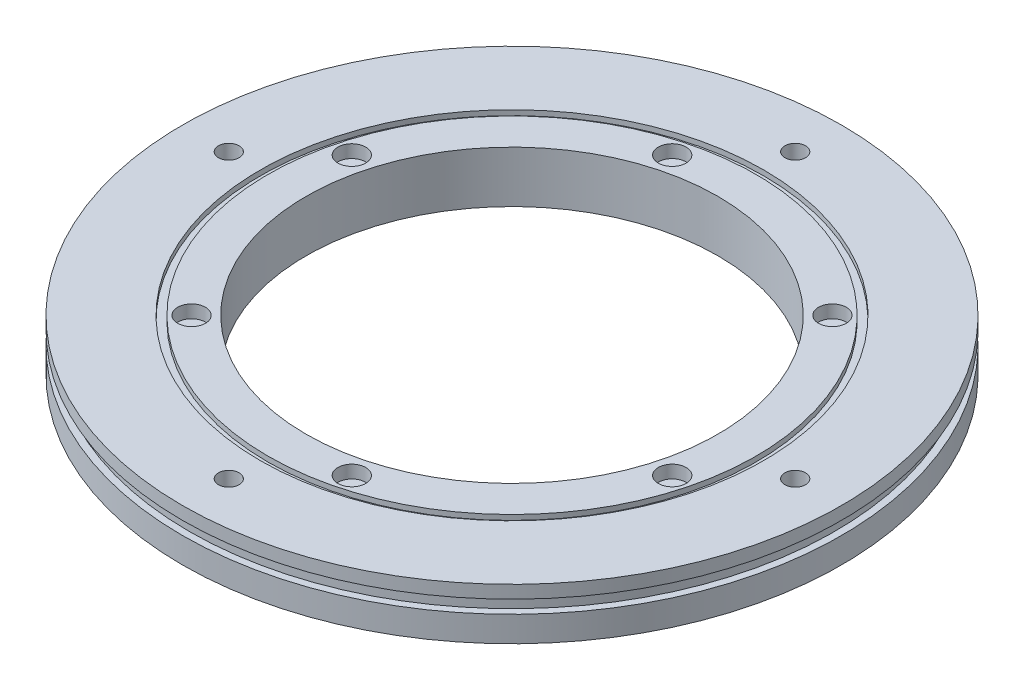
ISO-10303-21;
HEADER;
FILE_DESCRIPTION(('STEP AP214'),'2;1');
FILE_NAME('part.step','',(''),(''),'','','');
FILE_SCHEMA(('AUTOMOTIVE_DESIGN { 1 0 10303 214 1 1 1 1 }'));
ENDSEC;
DATA;
#1=APPLICATION_CONTEXT('core data for automotive mechanical design processes');
#2=APPLICATION_PROTOCOL_DEFINITION('international standard','automotive_design',2000,#1);
#3=PRODUCT_CONTEXT('',#1,'mechanical');
#4=PRODUCT('Part','Part','',(#3));
#5=PRODUCT_RELATED_PRODUCT_CATEGORY('part','',(#4));
#6=PRODUCT_DEFINITION_FORMATION('','',#4);
#7=PRODUCT_DEFINITION_CONTEXT('part definition',#1,'design');
#8=PRODUCT_DEFINITION('design','',#6,#7);
#9=PRODUCT_DEFINITION_SHAPE('','',#8);
#10=(LENGTH_UNIT() NAMED_UNIT(*) SI_UNIT(.MILLI.,.METRE.));
#11=(NAMED_UNIT(*) PLANE_ANGLE_UNIT() SI_UNIT($,.RADIAN.));
#12=(NAMED_UNIT(*) SI_UNIT($,.STERADIAN.) SOLID_ANGLE_UNIT());
#13=UNCERTAINTY_MEASURE_WITH_UNIT(LENGTH_MEASURE(1.E-05),#10,'distance_accuracy_value','');
#14=(GEOMETRIC_REPRESENTATION_CONTEXT(3) GLOBAL_UNCERTAINTY_ASSIGNED_CONTEXT((#13)) GLOBAL_UNIT_ASSIGNED_CONTEXT((#10,
#11,#12)) REPRESENTATION_CONTEXT('',''));
#15=CARTESIAN_POINT('',(0.,0.,0.));
#16=DIRECTION('',(0.,0.,1.));
#17=DIRECTION('',(1.,0.,0.));
#18=AXIS2_PLACEMENT_3D('',#15,#16,#17);
#19=CARTESIAN_POINT('',(0.,12.7,0.));
#20=DIRECTION('',(0.,1.,0.));
#21=DIRECTION('',(0.,0.,1.));
#22=AXIS2_PLACEMENT_3D('',#19,#20,#21);
#23=PLANE('',#22);
#24=CARTESIAN_POINT('',(14.4628082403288,12.7,53.9759351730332));
#25=DIRECTION('',(0.,1.,0.));
#26=DIRECTION('',(0.,0.,1.));
#27=AXIS2_PLACEMENT_3D('',#24,#25,#26);
#28=CIRCLE('',#27,3.429);
#29=CARTESIAN_POINT('',(14.4628082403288,12.7,57.4049351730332));
#30=VERTEX_POINT('',#29);
#31=EDGE_CURVE('E688',#30,#30,#28,.T.);
#32=ORIENTED_EDGE('',*,*,#31,.F.);
#33=EDGE_LOOP('',(#32));
#34=FACE_BOUND('',#33,.T.);
#35=CARTESIAN_POINT('',(-39.5131269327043,12.7,39.5131269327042));
#36=DIRECTION('',(0.,1.,0.));
#37=DIRECTION('',(0.,0.,1.));
#38=AXIS2_PLACEMENT_3D('',#35,#36,#37);
#39=CIRCLE('',#38,3.429);
#40=CARTESIAN_POINT('',(-39.5131269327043,12.7,42.9421269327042));
#41=VERTEX_POINT('',#40);
#42=EDGE_CURVE('E697',#41,#41,#39,.T.);
#43=ORIENTED_EDGE('',*,*,#42,.F.);
#44=EDGE_LOOP('',(#43));
#45=FACE_BOUND('',#44,.T.);
#46=CARTESIAN_POINT('',(-53.9759351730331,12.7,-14.462808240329));
#47=DIRECTION('',(0.,1.,0.));
#48=DIRECTION('',(0.,0.,1.));
#49=AXIS2_PLACEMENT_3D('',#46,#47,#48);
#50=CIRCLE('',#49,3.429);
#51=CARTESIAN_POINT('',(-53.9759351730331,12.7,-11.033808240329));
#52=VERTEX_POINT('',#51);
#53=EDGE_CURVE('E703',#52,#52,#50,.T.);
#54=ORIENTED_EDGE('',*,*,#53,.F.);
#55=EDGE_LOOP('',(#54));
#56=FACE_BOUND('',#55,.T.);
#57=CARTESIAN_POINT('',(-14.4628082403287,12.7,-53.9759351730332));
#58=DIRECTION('',(0.,1.,0.));
#59=DIRECTION('',(0.,0.,1.));
#60=AXIS2_PLACEMENT_3D('',#57,#58,#59);
#61=CIRCLE('',#60,3.429);
#62=CARTESIAN_POINT('',(-14.4628082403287,12.7,-50.5469351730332));
#63=VERTEX_POINT('',#62);
#64=EDGE_CURVE('E709',#63,#63,#61,.T.);
#65=ORIENTED_EDGE('',*,*,#64,.F.);
#66=EDGE_LOOP('',(#65));
#67=FACE_BOUND('',#66,.T.);
#68=CARTESIAN_POINT('',(39.5131269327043,12.7,-39.5131269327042));
#69=DIRECTION('',(0.,1.,0.));
#70=DIRECTION('',(0.,0.,1.));
#71=AXIS2_PLACEMENT_3D('',#68,#69,#70);
#72=CIRCLE('',#71,3.429);
#73=CARTESIAN_POINT('',(39.5131269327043,12.7,-36.0841269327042));
#74=VERTEX_POINT('',#73);
#75=EDGE_CURVE('E715',#74,#74,#72,.T.);
#76=ORIENTED_EDGE('',*,*,#75,.F.);
#77=EDGE_LOOP('',(#76));
#78=FACE_BOUND('',#77,.T.);
#79=CARTESIAN_POINT('',(53.9759351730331,12.7,14.462808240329));
#80=DIRECTION('',(0.,1.,0.));
#81=DIRECTION('',(0.,0.,1.));
#82=AXIS2_PLACEMENT_3D('',#79,#80,#81);
#83=CIRCLE('',#82,3.429);
#84=CARTESIAN_POINT('',(53.9759351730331,12.7,17.891808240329));
#85=VERTEX_POINT('',#84);
#86=EDGE_CURVE('E118',#85,#85,#83,.T.);
#87=ORIENTED_EDGE('',*,*,#86,.F.);
#88=EDGE_LOOP('',(#87));
#89=FACE_BOUND('',#88,.T.);
#90=CARTESIAN_POINT('',(0.,12.7,0.));
#91=DIRECTION('',(0.,1.,0.));
#92=DIRECTION('',(0.,0.,1.));
#93=AXIS2_PLACEMENT_3D('',#90,#91,#92);
#94=CIRCLE('',#93,50.8);
#95=CARTESIAN_POINT('',(0.,12.7,50.8));
#96=VERTEX_POINT('',#95);
#97=EDGE_CURVE('E50',#96,#96,#94,.T.);
#98=ORIENTED_EDGE('',*,*,#97,.F.);
#99=EDGE_LOOP('',(#98));
#100=FACE_BOUND('',#99,.T.);
#101=CARTESIAN_POINT('',(0.,12.7,0.));
#102=DIRECTION('',(0.,1.,0.));
#103=DIRECTION('',(0.,0.,1.));
#104=AXIS2_PLACEMENT_3D('',#101,#102,#103);
#105=CIRCLE('',#104,60.1853);
#106=CARTESIAN_POINT('',(0.,12.7,60.1853));
#107=VERTEX_POINT('',#106);
#108=EDGE_CURVE('E109',#107,#107,#105,.T.);
#109=ORIENTED_EDGE('',*,*,#108,.T.);
#110=EDGE_LOOP('',(#109));
#111=FACE_BOUND('',#110,.T.);
#112=ADVANCED_FACE('F34',(#34,#45,#56,#67,#78,#89,#100,#111),#23,.T.);
#113=CARTESIAN_POINT('',(0.,12.7,0.));
#114=DIRECTION('',(0.,-1.,0.));
#115=DIRECTION('',(0.,0.,-1.));
#116=AXIS2_PLACEMENT_3D('',#113,#114,#115);
#117=CYLINDRICAL_SURFACE('',#116,81.28);
#118=CARTESIAN_POINT('',(0.,0.,0.));
#119=DIRECTION('',(0.,1.,0.));
#120=DIRECTION('',(0.,0.,1.));
#121=AXIS2_PLACEMENT_3D('',#118,#119,#120);
#122=CIRCLE('',#121,81.28);
#123=CARTESIAN_POINT('',(0.,0.,81.28));
#124=VERTEX_POINT('',#123);
#125=EDGE_CURVE('E42',#124,#124,#122,.T.);
#126=ORIENTED_EDGE('',*,*,#125,.T.);
#127=EDGE_LOOP('',(#126));
#128=FACE_BOUND('',#127,.T.);
#129=CARTESIAN_POINT('',(0.,6.2992,0.));
#130=DIRECTION('',(0.,1.,0.));
#131=DIRECTION('',(0.,0.,1.));
#132=AXIS2_PLACEMENT_3D('',#129,#130,#131);
#133=CIRCLE('',#132,81.28);
#134=CARTESIAN_POINT('',(0.,6.2992,81.28));
#135=VERTEX_POINT('',#134);
#136=EDGE_CURVE('E38',#135,#135,#133,.T.);
#137=ORIENTED_EDGE('',*,*,#136,.F.);
#138=EDGE_LOOP('',(#137));
#139=FACE_BOUND('',#138,.T.);
#140=ADVANCED_FACE('F103',(#128,#139),#117,.T.);
#141=CARTESIAN_POINT('',(0.,9.525,0.));
#142=DIRECTION('',(0.,1.,0.));
#143=DIRECTION('',(0.,0.,1.));
#144=AXIS2_PLACEMENT_3D('',#141,#142,#143);
#145=CIRCLE('',#144,81.28);
#146=CARTESIAN_POINT('',(0.,9.525,81.28));
#147=VERTEX_POINT('',#146);
#148=EDGE_CURVE('E52',#147,#147,#145,.T.);
#149=ORIENTED_EDGE('',*,*,#148,.T.);
#150=EDGE_LOOP('',(#149));
#151=FACE_BOUND('',#150,.T.);
#152=CARTESIAN_POINT('',(0.,12.7,0.));
#153=DIRECTION('',(0.,1.,0.));
#154=DIRECTION('',(0.,0.,1.));
#155=AXIS2_PLACEMENT_3D('',#152,#153,#154);
#156=CIRCLE('',#155,81.28);
#157=CARTESIAN_POINT('',(0.,12.7,81.28));
#158=VERTEX_POINT('',#157);
#159=EDGE_CURVE('E10',#158,#158,#156,.T.);
#160=ORIENTED_EDGE('',*,*,#159,.F.);
#161=EDGE_LOOP('',(#160));
#162=FACE_BOUND('',#161,.T.);
#163=ADVANCED_FACE('F36',(#151,#162),#117,.T.);
#164=CARTESIAN_POINT('',(0.,12.7,0.));
#165=DIRECTION('',(0.,1.,0.));
#166=DIRECTION('',(0.,0.,1.));
#167=AXIS2_PLACEMENT_3D('',#164,#165,#166);
#168=CIRCLE('',#167,62.0903);
#169=CARTESIAN_POINT('',(0.,12.7,62.0903));
#170=VERTEX_POINT('',#169);
#171=EDGE_CURVE('E115',#170,#170,#168,.T.);
#172=ORIENTED_EDGE('',*,*,#171,.F.);
#173=EDGE_LOOP('',(#172));
#174=FACE_BOUND('',#173,.T.);
#175=CARTESIAN_POINT('',(0.,12.7,-69.85));
#176=DIRECTION('',(0.,-1.,0.));
#177=DIRECTION('',(0.,0.,-1.));
#178=AXIS2_PLACEMENT_3D('',#175,#176,#177);
#179=CIRCLE('',#178,2.5527);
#180=CARTESIAN_POINT('',(0.,12.7,-72.4027));
#181=VERTEX_POINT('',#180);
#182=EDGE_CURVE('E130',#181,#181,#179,.T.);
#183=ORIENTED_EDGE('',*,*,#182,.T.);
#184=EDGE_LOOP('',(#183));
#185=FACE_BOUND('',#184,.T.);
#186=CARTESIAN_POINT('',(-69.85,12.7,0.));
#187=DIRECTION('',(0.,-1.,0.));
#188=DIRECTION('',(0.,0.,-1.));
#189=AXIS2_PLACEMENT_3D('',#186,#187,#188);
#190=CIRCLE('',#189,2.55270000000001);
#191=CARTESIAN_POINT('',(-69.85,12.7,-2.55269999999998));
#192=VERTEX_POINT('',#191);
#193=EDGE_CURVE('E136',#192,#192,#190,.T.);
#194=ORIENTED_EDGE('',*,*,#193,.T.);
#195=EDGE_LOOP('',(#194));
#196=FACE_BOUND('',#195,.T.);
#197=CARTESIAN_POINT('',(0.,12.7,69.85));
#198=DIRECTION('',(0.,-1.,0.));
#199=DIRECTION('',(0.,0.,-1.));
#200=AXIS2_PLACEMENT_3D('',#197,#198,#199);
#201=CIRCLE('',#200,2.5527);
#202=CARTESIAN_POINT('',(0.,12.7,67.2973));
#203=VERTEX_POINT('',#202);
#204=EDGE_CURVE('E142',#203,#203,#201,.T.);
#205=ORIENTED_EDGE('',*,*,#204,.T.);
#206=EDGE_LOOP('',(#205));
#207=FACE_BOUND('',#206,.T.);
#208=CARTESIAN_POINT('',(69.85,12.7,0.));
#209=DIRECTION('',(0.,-1.,0.));
#210=DIRECTION('',(0.,0.,-1.));
#211=AXIS2_PLACEMENT_3D('',#208,#209,#210);
#212=CIRCLE('',#211,2.55270000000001);
#213=CARTESIAN_POINT('',(69.85,12.7,-2.55270000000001));
#214=VERTEX_POINT('',#213);
#215=EDGE_CURVE('E148',#214,#214,#212,.T.);
#216=ORIENTED_EDGE('',*,*,#215,.T.);
#217=EDGE_LOOP('',(#216));
#218=FACE_BOUND('',#217,.T.);
#219=ORIENTED_EDGE('',*,*,#159,.T.);
#220=EDGE_LOOP('',(#219));
#221=FACE_BOUND('',#220,.T.);
#222=ADVANCED_FACE('F106',(#174,#185,#196,#207,#218,#221),#23,.T.);
#223=CARTESIAN_POINT('',(0.,0.,0.));
#224=DIRECTION('',(0.,1.,0.));
#225=DIRECTION('',(0.,0.,1.));
#226=AXIS2_PLACEMENT_3D('',#223,#224,#225);
#227=PLANE('',#226);
#228=CARTESIAN_POINT('',(14.4628082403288,0.,53.9759351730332));
#229=DIRECTION('',(0.,-1.,0.));
#230=DIRECTION('',(0.,0.,-1.));
#231=AXIS2_PLACEMENT_3D('',#228,#229,#230);
#232=CIRCLE('',#231,3.175);
#233=CARTESIAN_POINT('',(14.4628082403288,0.,50.8009351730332));
#234=VERTEX_POINT('',#233);
#235=EDGE_CURVE('E155',#234,#234,#232,.T.);
#236=ORIENTED_EDGE('',*,*,#235,.F.);
#237=EDGE_LOOP('',(#236));
#238=FACE_BOUND('',#237,.T.);
#239=CARTESIAN_POINT('',(53.9759351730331,0.,14.462808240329));
#240=DIRECTION('',(0.,-1.,0.));
#241=DIRECTION('',(0.,0.,-1.));
#242=AXIS2_PLACEMENT_3D('',#239,#240,#241);
#243=CIRCLE('',#242,3.175);
#244=CARTESIAN_POINT('',(53.9759351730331,0.,11.287808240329));
#245=VERTEX_POINT('',#244);
#246=EDGE_CURVE('E161',#245,#245,#243,.T.);
#247=ORIENTED_EDGE('',*,*,#246,.F.);
#248=EDGE_LOOP('',(#247));
#249=FACE_BOUND('',#248,.T.);
#250=CARTESIAN_POINT('',(39.5131269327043,0.,-39.5131269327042));
#251=DIRECTION('',(0.,-1.,0.));
#252=DIRECTION('',(0.,0.,-1.));
#253=AXIS2_PLACEMENT_3D('',#250,#251,#252);
#254=CIRCLE('',#253,3.175);
#255=CARTESIAN_POINT('',(39.5131269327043,0.,-42.6881269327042));
#256=VERTEX_POINT('',#255);
#257=EDGE_CURVE('E167',#256,#256,#254,.T.);
#258=ORIENTED_EDGE('',*,*,#257,.F.);
#259=EDGE_LOOP('',(#258));
#260=FACE_BOUND('',#259,.T.);
#261=CARTESIAN_POINT('',(-14.4628082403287,0.,-53.9759351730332));
#262=DIRECTION('',(0.,-1.,0.));
#263=DIRECTION('',(0.,0.,-1.));
#264=AXIS2_PLACEMENT_3D('',#261,#262,#263);
#265=CIRCLE('',#264,3.175);
#266=CARTESIAN_POINT('',(-14.4628082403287,0.,-57.1509351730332));
#267=VERTEX_POINT('',#266);
#268=EDGE_CURVE('E173',#267,#267,#265,.T.);
#269=ORIENTED_EDGE('',*,*,#268,.F.);
#270=EDGE_LOOP('',(#269));
#271=FACE_BOUND('',#270,.T.);
#272=CARTESIAN_POINT('',(-53.9759351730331,0.,-14.462808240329));
#273=DIRECTION('',(0.,-1.,0.));
#274=DIRECTION('',(0.,0.,-1.));
#275=AXIS2_PLACEMENT_3D('',#272,#273,#274);
#276=CIRCLE('',#275,3.175);
#277=CARTESIAN_POINT('',(-53.9759351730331,0.,-17.637808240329));
#278=VERTEX_POINT('',#277);
#279=EDGE_CURVE('E151',#278,#278,#276,.T.);
#280=ORIENTED_EDGE('',*,*,#279,.F.);
#281=EDGE_LOOP('',(#280));
#282=FACE_BOUND('',#281,.T.);
#283=CARTESIAN_POINT('',(-39.5131269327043,0.,39.5131269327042));
#284=DIRECTION('',(0.,-1.,0.));
#285=DIRECTION('',(0.,0.,-1.));
#286=AXIS2_PLACEMENT_3D('',#283,#284,#285);
#287=CIRCLE('',#286,3.175);
#288=CARTESIAN_POINT('',(-39.5131269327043,0.,36.3381269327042));
#289=VERTEX_POINT('',#288);
#290=EDGE_CURVE('E68',#289,#289,#287,.T.);
#291=ORIENTED_EDGE('',*,*,#290,.F.);
#292=EDGE_LOOP('',(#291));
#293=FACE_BOUND('',#292,.T.);
#294=CARTESIAN_POINT('',(69.85,0.,0.));
#295=DIRECTION('',(0.,1.,0.));
#296=DIRECTION('',(0.,0.,1.));
#297=AXIS2_PLACEMENT_3D('',#294,#295,#296);
#298=CIRCLE('',#297,6.35000000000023);
#299=CARTESIAN_POINT('',(69.85,0.,6.35000000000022));
#300=VERTEX_POINT('',#299);
#301=EDGE_CURVE('E75',#300,#300,#298,.T.);
#302=ORIENTED_EDGE('',*,*,#301,.T.);
#303=EDGE_LOOP('',(#302));
#304=FACE_BOUND('',#303,.T.);
#305=CARTESIAN_POINT('',(0.,0.,69.85));
#306=DIRECTION('',(0.,1.,0.));
#307=DIRECTION('',(0.,0.,1.));
#308=AXIS2_PLACEMENT_3D('',#305,#306,#307);
#309=CIRCLE('',#308,6.35000000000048);
#310=CARTESIAN_POINT('',(0.,0.,76.2000000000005));
#311=VERTEX_POINT('',#310);
#312=EDGE_CURVE('E81',#311,#311,#309,.T.);
#313=ORIENTED_EDGE('',*,*,#312,.T.);
#314=EDGE_LOOP('',(#313));
#315=FACE_BOUND('',#314,.T.);
#316=CARTESIAN_POINT('',(-69.85,0.,0.));
#317=DIRECTION('',(0.,1.,0.));
#318=DIRECTION('',(0.,0.,1.));
#319=AXIS2_PLACEMENT_3D('',#316,#317,#318);
#320=CIRCLE('',#319,6.35000000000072);
#321=CARTESIAN_POINT('',(-69.85,0.,6.35000000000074));
#322=VERTEX_POINT('',#321);
#323=EDGE_CURVE('E58',#322,#322,#320,.T.);
#324=ORIENTED_EDGE('',*,*,#323,.T.);
#325=EDGE_LOOP('',(#324));
#326=FACE_BOUND('',#325,.T.);
#327=CARTESIAN_POINT('',(0.,0.,-69.85));
#328=DIRECTION('',(0.,1.,0.));
#329=DIRECTION('',(0.,0.,1.));
#330=AXIS2_PLACEMENT_3D('',#327,#328,#329);
#331=CIRCLE('',#330,6.35);
#332=CARTESIAN_POINT('',(0.,0.,-63.5));
#333=VERTEX_POINT('',#332);
#334=EDGE_CURVE('E74',#333,#333,#331,.T.);
#335=ORIENTED_EDGE('',*,*,#334,.T.);
#336=EDGE_LOOP('',(#335));
#337=FACE_BOUND('',#336,.T.);
#338=CARTESIAN_POINT('',(0.,0.,0.));
#339=DIRECTION('',(0.,1.,0.));
#340=DIRECTION('',(0.,0.,1.));
#341=AXIS2_PLACEMENT_3D('',#338,#339,#340);
#342=CIRCLE('',#341,50.8);
#343=CARTESIAN_POINT('',(0.,0.,50.8));
#344=VERTEX_POINT('',#343);
#345=EDGE_CURVE('E47',#344,#344,#342,.T.);
#346=ORIENTED_EDGE('',*,*,#345,.T.);
#347=EDGE_LOOP('',(#346));
#348=FACE_BOUND('',#347,.T.);
#349=ORIENTED_EDGE('',*,*,#125,.F.);
#350=EDGE_LOOP('',(#349));
#351=FACE_BOUND('',#350,.T.);
#352=ADVANCED_FACE('F188',(#238,#249,#260,#271,#282,#293,#304,#315,#326,#337,#348,#351),#227,.F.);
#353=CARTESIAN_POINT('',(0.,0.,0.));
#354=DIRECTION('',(0.,1.,0.));
#355=DIRECTION('',(0.,0.,1.));
#356=AXIS2_PLACEMENT_3D('',#353,#354,#355);
#357=CYLINDRICAL_SURFACE('',#356,50.8);
#358=ORIENTED_EDGE('',*,*,#345,.F.);
#359=EDGE_LOOP('',(#358));
#360=FACE_BOUND('',#359,.T.);
#361=ORIENTED_EDGE('',*,*,#97,.T.);
#362=EDGE_LOOP('',(#361));
#363=FACE_BOUND('',#362,.T.);
#364=ADVANCED_FACE('F99',(#360,#363),#357,.F.);
#365=CARTESIAN_POINT('',(0.,6.35,-69.85));
#366=DIRECTION('',(0.,-1.,0.));
#367=DIRECTION('',(0.,0.,-1.));
#368=AXIS2_PLACEMENT_3D('',#365,#366,#367);
#369=CYLINDRICAL_SURFACE('',#368,6.35);
#370=CARTESIAN_POINT('',(0.,6.35,-69.85));
#371=DIRECTION('',(0.,1.,0.));
#372=DIRECTION('',(0.,0.,1.));
#373=AXIS2_PLACEMENT_3D('',#370,#371,#372);
#374=CIRCLE('',#373,6.35);
#375=CARTESIAN_POINT('',(0.,6.35,-63.5));
#376=VERTEX_POINT('',#375);
#377=EDGE_CURVE('E89',#376,#376,#374,.T.);
#378=ORIENTED_EDGE('',*,*,#377,.T.);
#379=EDGE_LOOP('',(#378));
#380=FACE_BOUND('',#379,.T.);
#381=ORIENTED_EDGE('',*,*,#334,.F.);
#382=EDGE_LOOP('',(#381));
#383=FACE_BOUND('',#382,.T.);
#384=ADVANCED_FACE('F247',(#380,#383),#369,.F.);
#385=CARTESIAN_POINT('',(0.,6.35,-69.85));
#386=DIRECTION('',(0.,1.,0.));
#387=DIRECTION('',(0.,0.,1.));
#388=AXIS2_PLACEMENT_3D('',#385,#386,#387);
#389=PLANE('',#388);
#390=CARTESIAN_POINT('',(0.,6.35,-69.85));
#391=DIRECTION('',(0.,-1.,0.));
#392=DIRECTION('',(0.,0.,-1.));
#393=AXIS2_PLACEMENT_3D('',#390,#391,#392);
#394=CIRCLE('',#393,2.5527);
#395=CARTESIAN_POINT('',(0.,6.35,-72.4027));
#396=VERTEX_POINT('',#395);
#397=EDGE_CURVE('E125',#396,#396,#394,.T.);
#398=ORIENTED_EDGE('',*,*,#397,.F.);
#399=EDGE_LOOP('',(#398));
#400=FACE_BOUND('',#399,.T.);
#401=ORIENTED_EDGE('',*,*,#377,.F.);
#402=EDGE_LOOP('',(#401));
#403=FACE_BOUND('',#402,.T.);
#404=ADVANCED_FACE('F243',(#400,#403),#389,.F.);
#405=CARTESIAN_POINT('',(-69.85,6.35,0.));
#406=DIRECTION('',(0.,-1.,0.));
#407=DIRECTION('',(0.,0.,-1.));
#408=AXIS2_PLACEMENT_3D('',#405,#406,#407);
#409=CYLINDRICAL_SURFACE('',#408,6.35000000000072);
#410=CARTESIAN_POINT('',(-69.85,6.35,0.));
#411=DIRECTION('',(0.,1.,0.));
#412=DIRECTION('',(0.,0.,1.));
#413=AXIS2_PLACEMENT_3D('',#410,#411,#412);
#414=CIRCLE('',#413,6.35000000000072);
#415=CARTESIAN_POINT('',(-69.85,6.35,6.35000000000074));
#416=VERTEX_POINT('',#415);
#417=EDGE_CURVE('E84',#416,#416,#414,.T.);
#418=ORIENTED_EDGE('',*,*,#417,.T.);
#419=EDGE_LOOP('',(#418));
#420=FACE_BOUND('',#419,.T.);
#421=ORIENTED_EDGE('',*,*,#323,.F.);
#422=EDGE_LOOP('',(#421));
#423=FACE_BOUND('',#422,.T.);
#424=ADVANCED_FACE('F239',(#420,#423),#409,.F.);
#425=CARTESIAN_POINT('',(-69.85,6.35,0.));
#426=DIRECTION('',(0.,1.,0.));
#427=DIRECTION('',(0.,0.,1.));
#428=AXIS2_PLACEMENT_3D('',#425,#426,#427);
#429=PLANE('',#428);
#430=CARTESIAN_POINT('',(-69.85,6.35,0.));
#431=DIRECTION('',(0.,-1.,0.));
#432=DIRECTION('',(0.,0.,-1.));
#433=AXIS2_PLACEMENT_3D('',#430,#431,#432);
#434=CIRCLE('',#433,2.55270000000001);
#435=CARTESIAN_POINT('',(-69.85,6.35,-2.55269999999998));
#436=VERTEX_POINT('',#435);
#437=EDGE_CURVE('E133',#436,#436,#434,.T.);
#438=ORIENTED_EDGE('',*,*,#437,.F.);
#439=EDGE_LOOP('',(#438));
#440=FACE_BOUND('',#439,.T.);
#441=ORIENTED_EDGE('',*,*,#417,.F.);
#442=EDGE_LOOP('',(#441));
#443=FACE_BOUND('',#442,.T.);
#444=ADVANCED_FACE('F235',(#440,#443),#429,.F.);
#445=CARTESIAN_POINT('',(0.,6.35,69.85));
#446=DIRECTION('',(0.,-1.,0.));
#447=DIRECTION('',(0.,0.,-1.));
#448=AXIS2_PLACEMENT_3D('',#445,#446,#447);
#449=CYLINDRICAL_SURFACE('',#448,6.35000000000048);
#450=CARTESIAN_POINT('',(0.,6.35,69.85));
#451=DIRECTION('',(0.,1.,0.));
#452=DIRECTION('',(0.,0.,1.));
#453=AXIS2_PLACEMENT_3D('',#450,#451,#452);
#454=CIRCLE('',#453,6.35000000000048);
#455=CARTESIAN_POINT('',(0.,6.35,76.2000000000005));
#456=VERTEX_POINT('',#455);
#457=EDGE_CURVE('E78',#456,#456,#454,.T.);
#458=ORIENTED_EDGE('',*,*,#457,.T.);
#459=EDGE_LOOP('',(#458));
#460=FACE_BOUND('',#459,.T.);
#461=ORIENTED_EDGE('',*,*,#312,.F.);
#462=EDGE_LOOP('',(#461));
#463=FACE_BOUND('',#462,.T.);
#464=ADVANCED_FACE('F231',(#460,#463),#449,.F.);
#465=CARTESIAN_POINT('',(0.,6.35,69.85));
#466=DIRECTION('',(0.,1.,0.));
#467=DIRECTION('',(0.,0.,1.));
#468=AXIS2_PLACEMENT_3D('',#465,#466,#467);
#469=PLANE('',#468);
#470=CARTESIAN_POINT('',(0.,6.35,69.85));
#471=DIRECTION('',(0.,-1.,0.));
#472=DIRECTION('',(0.,0.,-1.));
#473=AXIS2_PLACEMENT_3D('',#470,#471,#472);
#474=CIRCLE('',#473,2.5527);
#475=CARTESIAN_POINT('',(0.,6.35,67.2973));
#476=VERTEX_POINT('',#475);
#477=EDGE_CURVE('E139',#476,#476,#474,.T.);
#478=ORIENTED_EDGE('',*,*,#477,.F.);
#479=EDGE_LOOP('',(#478));
#480=FACE_BOUND('',#479,.T.);
#481=ORIENTED_EDGE('',*,*,#457,.F.);
#482=EDGE_LOOP('',(#481));
#483=FACE_BOUND('',#482,.T.);
#484=ADVANCED_FACE('F227',(#480,#483),#469,.F.);
#485=CARTESIAN_POINT('',(69.85,6.35,0.));
#486=DIRECTION('',(0.,-1.,0.));
#487=DIRECTION('',(0.,0.,-1.));
#488=AXIS2_PLACEMENT_3D('',#485,#486,#487);
#489=CYLINDRICAL_SURFACE('',#488,6.35000000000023);
#490=CARTESIAN_POINT('',(69.85,6.35,0.));
#491=DIRECTION('',(0.,1.,0.));
#492=DIRECTION('',(0.,0.,1.));
#493=AXIS2_PLACEMENT_3D('',#490,#491,#492);
#494=CIRCLE('',#493,6.35000000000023);
#495=CARTESIAN_POINT('',(69.85,6.35,6.35000000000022));
#496=VERTEX_POINT('',#495);
#497=EDGE_CURVE('E71',#496,#496,#494,.T.);
#498=ORIENTED_EDGE('',*,*,#497,.T.);
#499=EDGE_LOOP('',(#498));
#500=FACE_BOUND('',#499,.T.);
#501=ORIENTED_EDGE('',*,*,#301,.F.);
#502=EDGE_LOOP('',(#501));
#503=FACE_BOUND('',#502,.T.);
#504=ADVANCED_FACE('F219',(#500,#503),#489,.F.);
#505=CARTESIAN_POINT('',(69.85,6.35,0.));
#506=DIRECTION('',(0.,1.,0.));
#507=DIRECTION('',(0.,0.,1.));
#508=AXIS2_PLACEMENT_3D('',#505,#506,#507);
#509=PLANE('',#508);
#510=CARTESIAN_POINT('',(69.85,6.35,0.));
#511=DIRECTION('',(0.,-1.,0.));
#512=DIRECTION('',(0.,0.,-1.));
#513=AXIS2_PLACEMENT_3D('',#510,#511,#512);
#514=CIRCLE('',#513,2.55270000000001);
#515=CARTESIAN_POINT('',(69.85,6.35,-2.55270000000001));
#516=VERTEX_POINT('',#515);
#517=EDGE_CURVE('E145',#516,#516,#514,.T.);
#518=ORIENTED_EDGE('',*,*,#517,.F.);
#519=EDGE_LOOP('',(#518));
#520=FACE_BOUND('',#519,.T.);
#521=ORIENTED_EDGE('',*,*,#497,.F.);
#522=EDGE_LOOP('',(#521));
#523=FACE_BOUND('',#522,.T.);
#524=ADVANCED_FACE('F209',(#520,#523),#509,.F.);
#525=CARTESIAN_POINT('',(0.,6.2992,0.));
#526=DIRECTION('',(0.,1.,0.));
#527=DIRECTION('',(0.,0.,1.));
#528=AXIS2_PLACEMENT_3D('',#525,#526,#527);
#529=PLANE('',#528);
#530=CARTESIAN_POINT('',(0.,6.2992,0.));
#531=DIRECTION('',(0.,1.,0.));
#532=DIRECTION('',(0.,0.,1.));
#533=AXIS2_PLACEMENT_3D('',#530,#531,#532);
#534=CIRCLE('',#533,79.5782);
#535=CARTESIAN_POINT('',(0.,6.2992,79.5782));
#536=VERTEX_POINT('',#535);
#537=EDGE_CURVE('E54',#536,#536,#534,.T.);
#538=ORIENTED_EDGE('',*,*,#537,.F.);
#539=EDGE_LOOP('',(#538));
#540=FACE_BOUND('',#539,.T.);
#541=ORIENTED_EDGE('',*,*,#136,.T.);
#542=EDGE_LOOP('',(#541));
#543=FACE_BOUND('',#542,.T.);
#544=ADVANCED_FACE('F206',(#540,#543),#529,.T.);
#545=CARTESIAN_POINT('',(0.,9.525,0.));
#546=DIRECTION('',(0.,1.,0.));
#547=DIRECTION('',(0.,0.,1.));
#548=AXIS2_PLACEMENT_3D('',#545,#546,#547);
#549=PLANE('',#548);
#550=CARTESIAN_POINT('',(0.,9.525,0.));
#551=DIRECTION('',(0.,1.,0.));
#552=DIRECTION('',(0.,0.,1.));
#553=AXIS2_PLACEMENT_3D('',#550,#551,#552);
#554=CIRCLE('',#553,79.5782);
#555=CARTESIAN_POINT('',(0.,9.525,79.5782));
#556=VERTEX_POINT('',#555);
#557=EDGE_CURVE('E60',#556,#556,#554,.T.);
#558=ORIENTED_EDGE('',*,*,#557,.T.);
#559=EDGE_LOOP('',(#558));
#560=FACE_BOUND('',#559,.T.);
#561=ORIENTED_EDGE('',*,*,#148,.F.);
#562=EDGE_LOOP('',(#561));
#563=FACE_BOUND('',#562,.T.);
#564=ADVANCED_FACE('F208',(#560,#563),#549,.F.);
#565=CARTESIAN_POINT('',(0.,6.2992,0.));
#566=DIRECTION('',(0.,1.,0.));
#567=DIRECTION('',(0.,0.,1.));
#568=AXIS2_PLACEMENT_3D('',#565,#566,#567);
#569=CYLINDRICAL_SURFACE('',#568,79.5782);
#570=ORIENTED_EDGE('',*,*,#537,.T.);
#571=EDGE_LOOP('',(#570));
#572=FACE_BOUND('',#571,.T.);
#573=ORIENTED_EDGE('',*,*,#557,.F.);
#574=EDGE_LOOP('',(#573));
#575=FACE_BOUND('',#574,.T.);
#576=ADVANCED_FACE('F216',(#572,#575),#569,.T.);
#577=CARTESIAN_POINT('',(-39.5131269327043,7.62,39.5131269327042));
#578=DIRECTION('',(0.,-1.,0.));
#579=DIRECTION('',(0.,0.,-1.));
#580=AXIS2_PLACEMENT_3D('',#577,#578,#579);
#581=CYLINDRICAL_SURFACE('',#580,3.175);
#582=CARTESIAN_POINT('',(-39.5131269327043,7.62,39.5131269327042));
#583=DIRECTION('',(0.,-1.,0.));
#584=DIRECTION('',(0.,0.,-1.));
#585=AXIS2_PLACEMENT_3D('',#582,#583,#584);
#586=CIRCLE('',#585,3.175);
#587=CARTESIAN_POINT('',(-39.5131269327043,7.62,36.3381269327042));
#588=VERTEX_POINT('',#587);
#589=EDGE_CURVE('E65',#588,#588,#586,.T.);
#590=CARTESIAN_POINT('',(-39.5131269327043,7.62,36.3381269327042));
#591=CARTESIAN_POINT('',(-39.5131269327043,7.540625,36.3381269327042));
#592=CARTESIAN_POINT('',(-39.5131269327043,7.46125,36.3381269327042));
#593=CARTESIAN_POINT('',(-39.5131269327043,7.3025,36.3381269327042));
#594=CARTESIAN_POINT('',(-39.5131269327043,7.223125,36.3381269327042));
#595=CARTESIAN_POINT('',(-39.5131269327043,7.064375,36.3381269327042));
#596=CARTESIAN_POINT('',(-39.5131269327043,6.985,36.3381269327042));
#597=CARTESIAN_POINT('',(-39.5131269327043,6.82625,36.3381269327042));
#598=CARTESIAN_POINT('',(-39.5131269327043,6.746875,36.3381269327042));
#599=CARTESIAN_POINT('',(-39.5131269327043,6.588125,36.3381269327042));
#600=CARTESIAN_POINT('',(-39.5131269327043,6.50875,36.3381269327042));
#601=CARTESIAN_POINT('',(-39.5131269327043,6.35,36.3381269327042));
#602=CARTESIAN_POINT('',(-39.5131269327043,6.270625,36.3381269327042));
#603=CARTESIAN_POINT('',(-39.5131269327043,6.111875,36.3381269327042));
#604=CARTESIAN_POINT('',(-39.5131269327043,6.0325,36.3381269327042));
#605=CARTESIAN_POINT('',(-39.5131269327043,5.87375,36.3381269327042));
#606=CARTESIAN_POINT('',(-39.5131269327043,5.794375,36.3381269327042));
#607=CARTESIAN_POINT('',(-39.5131269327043,5.635625,36.3381269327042));
#608=CARTESIAN_POINT('',(-39.5131269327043,5.55625,36.3381269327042));
#609=CARTESIAN_POINT('',(-39.5131269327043,5.3975,36.3381269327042));
#610=CARTESIAN_POINT('',(-39.5131269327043,5.318125,36.3381269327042));
#611=CARTESIAN_POINT('',(-39.5131269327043,5.159375,36.3381269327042));
#612=CARTESIAN_POINT('',(-39.5131269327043,5.08,36.3381269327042));
#613=CARTESIAN_POINT('',(-39.5131269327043,4.92125,36.3381269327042));
#614=CARTESIAN_POINT('',(-39.5131269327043,4.841875,36.3381269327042));
#615=CARTESIAN_POINT('',(-39.5131269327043,4.683125,36.3381269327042));
#616=CARTESIAN_POINT('',(-39.5131269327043,4.60375,36.3381269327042));
#617=CARTESIAN_POINT('',(-39.5131269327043,4.445,36.3381269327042));
#618=CARTESIAN_POINT('',(-39.5131269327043,4.365625,36.3381269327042));
#619=CARTESIAN_POINT('',(-39.5131269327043,4.206875,36.3381269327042));
#620=CARTESIAN_POINT('',(-39.5131269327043,4.1275,36.3381269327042));
#621=CARTESIAN_POINT('',(-39.5131269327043,3.96875,36.3381269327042));
#622=CARTESIAN_POINT('',(-39.5131269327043,3.889375,36.3381269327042));
#623=CARTESIAN_POINT('',(-39.5131269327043,3.730625,36.3381269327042));
#624=CARTESIAN_POINT('',(-39.5131269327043,3.65125,36.3381269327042));
#625=CARTESIAN_POINT('',(-39.5131269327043,3.4925,36.3381269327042));
#626=CARTESIAN_POINT('',(-39.5131269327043,3.413125,36.3381269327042));
#627=CARTESIAN_POINT('',(-39.5131269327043,3.254375,36.3381269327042));
#628=CARTESIAN_POINT('',(-39.5131269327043,3.175,36.3381269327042));
#629=CARTESIAN_POINT('',(-39.5131269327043,3.01625,36.3381269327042));
#630=CARTESIAN_POINT('',(-39.5131269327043,2.936875,36.3381269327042));
#631=CARTESIAN_POINT('',(-39.5131269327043,2.778125,36.3381269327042));
#632=CARTESIAN_POINT('',(-39.5131269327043,2.69875,36.3381269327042));
#633=CARTESIAN_POINT('',(-39.5131269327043,2.54,36.3381269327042));
#634=CARTESIAN_POINT('',(-39.5131269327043,2.460625,36.3381269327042));
#635=CARTESIAN_POINT('',(-39.5131269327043,2.301875,36.3381269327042));
#636=CARTESIAN_POINT('',(-39.5131269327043,2.2225,36.3381269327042));
#637=CARTESIAN_POINT('',(-39.5131269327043,2.06375,36.3381269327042));
#638=CARTESIAN_POINT('',(-39.5131269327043,1.984375,36.3381269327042));
#639=CARTESIAN_POINT('',(-39.5131269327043,1.825625,36.3381269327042));
#640=CARTESIAN_POINT('',(-39.5131269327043,1.74625,36.3381269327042));
#641=CARTESIAN_POINT('',(-39.5131269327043,1.5875,36.3381269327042));
#642=CARTESIAN_POINT('',(-39.5131269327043,1.508125,36.3381269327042));
#643=CARTESIAN_POINT('',(-39.5131269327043,1.349375,36.3381269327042));
#644=CARTESIAN_POINT('',(-39.5131269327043,1.27,36.3381269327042));
#645=CARTESIAN_POINT('',(-39.5131269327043,1.11125,36.3381269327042));
#646=CARTESIAN_POINT('',(-39.5131269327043,1.031875,36.3381269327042));
#647=CARTESIAN_POINT('',(-39.5131269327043,0.873125,36.3381269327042));
#648=CARTESIAN_POINT('',(-39.5131269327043,0.79375,36.3381269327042));
#649=CARTESIAN_POINT('',(-39.5131269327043,0.635,36.3381269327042));
#650=CARTESIAN_POINT('',(-39.5131269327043,0.555625,36.3381269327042));
#651=CARTESIAN_POINT('',(-39.5131269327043,0.396875,36.3381269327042));
#652=CARTESIAN_POINT('',(-39.5131269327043,0.3175,36.3381269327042));
#653=CARTESIAN_POINT('',(-39.5131269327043,0.15875,36.3381269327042));
#654=CARTESIAN_POINT('',(-39.5131269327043,0.0793749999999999,36.3381269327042));
#655=CARTESIAN_POINT('',(-39.5131269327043,0.,36.3381269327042));
#656=B_SPLINE_CURVE_WITH_KNOTS('',3,(#590,#591,#592,#593,#594,#595,#596,#597,#598,#599,#600,
#601,#602,#603,#604,#605,#606,#607,#608,#609,#610,#611,#612,#613,#614,#615,#616,#617,#618,#619,
#620,#621,#622,#623,#624,#625,#626,#627,#628,#629,#630,#631,#632,#633,#634,#635,#636,#637,#638,
#639,#640,#641,#642,#643,#644,#645,#646,#647,#648,#649,#650,#651,#652,#653,#654,#655),
.UNSPECIFIED.,.F.,.F.,(4,2,2,2,2,2,2,2,2,2,2,2,2,2,2,2,2,2,2,2,2,2,2,2,2,2,2,2,2,2,2,2,4),(0.,
0.238125,0.476249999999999,0.714375,0.952499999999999,1.190625,1.42875,1.666875,1.905,2.143125,
2.38125,2.619375,2.8575,3.095625,3.33375,3.571875,3.81,4.048125,4.28625,4.524375,4.7625,
5.000625,5.23875,5.476875,5.715,5.953125,6.19125,6.429375,6.6675,6.905625,7.14375,7.381875,
7.62),.UNSPECIFIED.);
#657=EDGE_CURVE('BSEAM186',#588,#289,#656,.T.);
#658=ORIENTED_EDGE('',*,*,#589,.F.);
#659=ORIENTED_EDGE('',*,*,#290,.T.);
#660=ORIENTED_EDGE('',*,*,#657,.T.);
#661=ORIENTED_EDGE('',*,*,#657,.F.);
#662=EDGE_LOOP('',(#658,#660,#659,#661));
#663=FACE_BOUND('',#662,.T.);
#664=ADVANCED_FACE('F186',(#663),#581,.F.);
#665=CARTESIAN_POINT('',(-39.5131269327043,7.62,39.5131269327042));
#666=DIRECTION('',(0.,-1.,0.));
#667=DIRECTION('',(0.,0.,-1.));
#668=AXIS2_PLACEMENT_3D('',#665,#666,#667);
#669=PLANE('',#668);
#670=ORIENTED_EDGE('',*,*,#589,.T.);
#671=EDGE_LOOP('',(#670));
#672=FACE_BOUND('',#671,.T.);
#673=ADVANCED_FACE('F325',(#672),#669,.T.);
#674=CARTESIAN_POINT('',(-53.9759351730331,7.62,-14.462808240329));
#675=DIRECTION('',(0.,-1.,0.));
#676=DIRECTION('',(0.,0.,-1.));
#677=AXIS2_PLACEMENT_3D('',#674,#675,#676);
#678=CYLINDRICAL_SURFACE('',#677,3.175);
#679=CARTESIAN_POINT('',(-53.9759351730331,7.62,-14.462808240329));
#680=DIRECTION('',(0.,-1.,0.));
#681=DIRECTION('',(0.,0.,-1.));
#682=AXIS2_PLACEMENT_3D('',#679,#680,#681);
#683=CIRCLE('',#682,3.175);
#684=CARTESIAN_POINT('',(-53.9759351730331,7.62,-17.637808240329));
#685=VERTEX_POINT('',#684);
#686=EDGE_CURVE('E176',#685,#685,#683,.T.);
#687=CARTESIAN_POINT('',(-53.9759351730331,7.62,-17.637808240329));
#688=CARTESIAN_POINT('',(-53.9759351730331,7.540625,-17.637808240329));
#689=CARTESIAN_POINT('',(-53.9759351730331,7.46125,-17.637808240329));
#690=CARTESIAN_POINT('',(-53.9759351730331,7.3025,-17.637808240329));
#691=CARTESIAN_POINT('',(-53.9759351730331,7.223125,-17.637808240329));
#692=CARTESIAN_POINT('',(-53.9759351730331,7.064375,-17.637808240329));
#693=CARTESIAN_POINT('',(-53.9759351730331,6.985,-17.637808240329));
#694=CARTESIAN_POINT('',(-53.9759351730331,6.82625,-17.637808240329));
#695=CARTESIAN_POINT('',(-53.9759351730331,6.746875,-17.637808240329));
#696=CARTESIAN_POINT('',(-53.9759351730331,6.588125,-17.637808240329));
#697=CARTESIAN_POINT('',(-53.9759351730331,6.50875,-17.637808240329));
#698=CARTESIAN_POINT('',(-53.9759351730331,6.35,-17.637808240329));
#699=CARTESIAN_POINT('',(-53.9759351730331,6.270625,-17.637808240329));
#700=CARTESIAN_POINT('',(-53.9759351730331,6.111875,-17.637808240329));
#701=CARTESIAN_POINT('',(-53.9759351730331,6.0325,-17.637808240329));
#702=CARTESIAN_POINT('',(-53.9759351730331,5.87375,-17.637808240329));
#703=CARTESIAN_POINT('',(-53.9759351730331,5.794375,-17.637808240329));
#704=CARTESIAN_POINT('',(-53.9759351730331,5.635625,-17.637808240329));
#705=CARTESIAN_POINT('',(-53.9759351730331,5.55625,-17.637808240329));
#706=CARTESIAN_POINT('',(-53.9759351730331,5.3975,-17.637808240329));
#707=CARTESIAN_POINT('',(-53.9759351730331,5.318125,-17.637808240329));
#708=CARTESIAN_POINT('',(-53.9759351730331,5.159375,-17.637808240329));
#709=CARTESIAN_POINT('',(-53.9759351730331,5.08,-17.637808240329));
#710=CARTESIAN_POINT('',(-53.9759351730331,4.92125,-17.637808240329));
#711=CARTESIAN_POINT('',(-53.9759351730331,4.841875,-17.637808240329));
#712=CARTESIAN_POINT('',(-53.9759351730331,4.683125,-17.637808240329));
#713=CARTESIAN_POINT('',(-53.9759351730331,4.60375,-17.637808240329));
#714=CARTESIAN_POINT('',(-53.9759351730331,4.445,-17.637808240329));
#715=CARTESIAN_POINT('',(-53.9759351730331,4.365625,-17.637808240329));
#716=CARTESIAN_POINT('',(-53.9759351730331,4.206875,-17.637808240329));
#717=CARTESIAN_POINT('',(-53.9759351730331,4.1275,-17.637808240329));
#718=CARTESIAN_POINT('',(-53.9759351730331,3.96875,-17.637808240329));
#719=CARTESIAN_POINT('',(-53.9759351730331,3.889375,-17.637808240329));
#720=CARTESIAN_POINT('',(-53.9759351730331,3.730625,-17.637808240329));
#721=CARTESIAN_POINT('',(-53.9759351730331,3.65125,-17.637808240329));
#722=CARTESIAN_POINT('',(-53.9759351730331,3.4925,-17.637808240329));
#723=CARTESIAN_POINT('',(-53.9759351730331,3.413125,-17.637808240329));
#724=CARTESIAN_POINT('',(-53.9759351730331,3.254375,-17.637808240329));
#725=CARTESIAN_POINT('',(-53.9759351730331,3.175,-17.637808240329));
#726=CARTESIAN_POINT('',(-53.9759351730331,3.01625,-17.637808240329));
#727=CARTESIAN_POINT('',(-53.9759351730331,2.936875,-17.637808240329));
#728=CARTESIAN_POINT('',(-53.9759351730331,2.778125,-17.637808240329));
#729=CARTESIAN_POINT('',(-53.9759351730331,2.69875,-17.637808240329));
#730=CARTESIAN_POINT('',(-53.9759351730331,2.54,-17.637808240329));
#731=CARTESIAN_POINT('',(-53.9759351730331,2.460625,-17.637808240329));
#732=CARTESIAN_POINT('',(-53.9759351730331,2.301875,-17.637808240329));
#733=CARTESIAN_POINT('',(-53.9759351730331,2.2225,-17.637808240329));
#734=CARTESIAN_POINT('',(-53.9759351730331,2.06375,-17.637808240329));
#735=CARTESIAN_POINT('',(-53.9759351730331,1.984375,-17.637808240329));
#736=CARTESIAN_POINT('',(-53.9759351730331,1.825625,-17.637808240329));
#737=CARTESIAN_POINT('',(-53.9759351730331,1.74625,-17.637808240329));
#738=CARTESIAN_POINT('',(-53.9759351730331,1.5875,-17.637808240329));
#739=CARTESIAN_POINT('',(-53.9759351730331,1.508125,-17.637808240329));
#740=CARTESIAN_POINT('',(-53.9759351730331,1.349375,-17.637808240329));
#741=CARTESIAN_POINT('',(-53.9759351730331,1.27,-17.637808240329));
#742=CARTESIAN_POINT('',(-53.9759351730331,1.11125,-17.637808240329));
#743=CARTESIAN_POINT('',(-53.9759351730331,1.031875,-17.637808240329));
#744=CARTESIAN_POINT('',(-53.9759351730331,0.873125,-17.637808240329));
#745=CARTESIAN_POINT('',(-53.9759351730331,0.79375,-17.637808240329));
#746=CARTESIAN_POINT('',(-53.9759351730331,0.635,-17.637808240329));
#747=CARTESIAN_POINT('',(-53.9759351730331,0.555625,-17.637808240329));
#748=CARTESIAN_POINT('',(-53.9759351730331,0.396875,-17.637808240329));
#749=CARTESIAN_POINT('',(-53.9759351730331,0.3175,-17.637808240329));
#750=CARTESIAN_POINT('',(-53.9759351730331,0.15875,-17.637808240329));
#751=CARTESIAN_POINT('',(-53.9759351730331,0.0793749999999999,-17.637808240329));
#752=CARTESIAN_POINT('',(-53.9759351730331,0.,-17.637808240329));
#753=B_SPLINE_CURVE_WITH_KNOTS('',3,(#687,#688,#689,#690,#691,#692,#693,#694,#695,#696,#697,
#698,#699,#700,#701,#702,#703,#704,#705,#706,#707,#708,#709,#710,#711,#712,#713,#714,#715,#716,
#717,#718,#719,#720,#721,#722,#723,#724,#725,#726,#727,#728,#729,#730,#731,#732,#733,#734,#735,
#736,#737,#738,#739,#740,#741,#742,#743,#744,#745,#746,#747,#748,#749,#750,#751,#752),
.UNSPECIFIED.,.F.,.F.,(4,2,2,2,2,2,2,2,2,2,2,2,2,2,2,2,2,2,2,2,2,2,2,2,2,2,2,2,2,2,2,2,4),(0.,
0.238125,0.476249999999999,0.714375,0.952499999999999,1.190625,1.42875,1.666875,1.905,2.143125,
2.38125,2.619375,2.8575,3.095625,3.33375,3.571875,3.81,4.048125,4.28625,4.524375,4.7625,
5.000625,5.23875,5.476875,5.715,5.953125,6.19125,6.429375,6.6675,6.905625,7.14375,7.381875,
7.62),.UNSPECIFIED.);
#754=EDGE_CURVE('BSEAM321',#685,#278,#753,.T.);
#755=ORIENTED_EDGE('',*,*,#686,.F.);
#756=ORIENTED_EDGE('',*,*,#279,.T.);
#757=ORIENTED_EDGE('',*,*,#754,.T.);
#758=ORIENTED_EDGE('',*,*,#754,.F.);
#759=EDGE_LOOP('',(#755,#757,#756,#758));
#760=FACE_BOUND('',#759,.T.);
#761=ADVANCED_FACE('F321',(#760),#678,.F.);
#762=CARTESIAN_POINT('',(-53.9759351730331,7.62,-14.462808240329));
#763=DIRECTION('',(0.,-1.,0.));
#764=DIRECTION('',(0.,0.,-1.));
#765=AXIS2_PLACEMENT_3D('',#762,#763,#764);
#766=PLANE('',#765);
#767=ORIENTED_EDGE('',*,*,#686,.T.);
#768=EDGE_LOOP('',(#767));
#769=FACE_BOUND('',#768,.T.);
#770=ADVANCED_FACE('F317',(#769),#766,.T.);
#771=CARTESIAN_POINT('',(-14.4628082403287,7.62,-53.9759351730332));
#772=DIRECTION('',(0.,-1.,0.));
#773=DIRECTION('',(0.,0.,-1.));
#774=AXIS2_PLACEMENT_3D('',#771,#772,#773);
#775=CYLINDRICAL_SURFACE('',#774,3.175);
#776=CARTESIAN_POINT('',(-14.4628082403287,7.62,-53.9759351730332));
#777=DIRECTION('',(0.,-1.,0.));
#778=DIRECTION('',(0.,0.,-1.));
#779=AXIS2_PLACEMENT_3D('',#776,#777,#778);
#780=CIRCLE('',#779,3.175);
#781=CARTESIAN_POINT('',(-14.4628082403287,7.62,-57.1509351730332));
#782=VERTEX_POINT('',#781);
#783=EDGE_CURVE('E170',#782,#782,#780,.T.);
#784=CARTESIAN_POINT('',(-14.4628082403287,7.62,-57.1509351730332));
#785=CARTESIAN_POINT('',(-14.4628082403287,7.540625,-57.1509351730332));
#786=CARTESIAN_POINT('',(-14.4628082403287,7.46125,-57.1509351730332));
#787=CARTESIAN_POINT('',(-14.4628082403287,7.3025,-57.1509351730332));
#788=CARTESIAN_POINT('',(-14.4628082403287,7.223125,-57.1509351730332));
#789=CARTESIAN_POINT('',(-14.4628082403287,7.064375,-57.1509351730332));
#790=CARTESIAN_POINT('',(-14.4628082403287,6.985,-57.1509351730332));
#791=CARTESIAN_POINT('',(-14.4628082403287,6.82625,-57.1509351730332));
#792=CARTESIAN_POINT('',(-14.4628082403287,6.746875,-57.1509351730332));
#793=CARTESIAN_POINT('',(-14.4628082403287,6.588125,-57.1509351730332));
#794=CARTESIAN_POINT('',(-14.4628082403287,6.50875,-57.1509351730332));
#795=CARTESIAN_POINT('',(-14.4628082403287,6.35,-57.1509351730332));
#796=CARTESIAN_POINT('',(-14.4628082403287,6.270625,-57.1509351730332));
#797=CARTESIAN_POINT('',(-14.4628082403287,6.111875,-57.1509351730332));
#798=CARTESIAN_POINT('',(-14.4628082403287,6.0325,-57.1509351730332));
#799=CARTESIAN_POINT('',(-14.4628082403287,5.87375,-57.1509351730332));
#800=CARTESIAN_POINT('',(-14.4628082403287,5.794375,-57.1509351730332));
#801=CARTESIAN_POINT('',(-14.4628082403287,5.635625,-57.1509351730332));
#802=CARTESIAN_POINT('',(-14.4628082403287,5.55625,-57.1509351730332));
#803=CARTESIAN_POINT('',(-14.4628082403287,5.3975,-57.1509351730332));
#804=CARTESIAN_POINT('',(-14.4628082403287,5.318125,-57.1509351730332));
#805=CARTESIAN_POINT('',(-14.4628082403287,5.159375,-57.1509351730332));
#806=CARTESIAN_POINT('',(-14.4628082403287,5.08,-57.1509351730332));
#807=CARTESIAN_POINT('',(-14.4628082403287,4.92125,-57.1509351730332));
#808=CARTESIAN_POINT('',(-14.4628082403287,4.841875,-57.1509351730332));
#809=CARTESIAN_POINT('',(-14.4628082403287,4.683125,-57.1509351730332));
#810=CARTESIAN_POINT('',(-14.4628082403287,4.60375,-57.1509351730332));
#811=CARTESIAN_POINT('',(-14.4628082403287,4.445,-57.1509351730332));
#812=CARTESIAN_POINT('',(-14.4628082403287,4.365625,-57.1509351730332));
#813=CARTESIAN_POINT('',(-14.4628082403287,4.206875,-57.1509351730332));
#814=CARTESIAN_POINT('',(-14.4628082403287,4.1275,-57.1509351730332));
#815=CARTESIAN_POINT('',(-14.4628082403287,3.96875,-57.1509351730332));
#816=CARTESIAN_POINT('',(-14.4628082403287,3.889375,-57.1509351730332));
#817=CARTESIAN_POINT('',(-14.4628082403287,3.730625,-57.1509351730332));
#818=CARTESIAN_POINT('',(-14.4628082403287,3.65125,-57.1509351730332));
#819=CARTESIAN_POINT('',(-14.4628082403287,3.4925,-57.1509351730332));
#820=CARTESIAN_POINT('',(-14.4628082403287,3.413125,-57.1509351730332));
#821=CARTESIAN_POINT('',(-14.4628082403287,3.254375,-57.1509351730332));
#822=CARTESIAN_POINT('',(-14.4628082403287,3.175,-57.1509351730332));
#823=CARTESIAN_POINT('',(-14.4628082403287,3.01625,-57.1509351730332));
#824=CARTESIAN_POINT('',(-14.4628082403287,2.936875,-57.1509351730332));
#825=CARTESIAN_POINT('',(-14.4628082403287,2.778125,-57.1509351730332));
#826=CARTESIAN_POINT('',(-14.4628082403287,2.69875,-57.1509351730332));
#827=CARTESIAN_POINT('',(-14.4628082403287,2.54,-57.1509351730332));
#828=CARTESIAN_POINT('',(-14.4628082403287,2.460625,-57.1509351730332));
#829=CARTESIAN_POINT('',(-14.4628082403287,2.301875,-57.1509351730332));
#830=CARTESIAN_POINT('',(-14.4628082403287,2.2225,-57.1509351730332));
#831=CARTESIAN_POINT('',(-14.4628082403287,2.06375,-57.1509351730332));
#832=CARTESIAN_POINT('',(-14.4628082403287,1.984375,-57.1509351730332));
#833=CARTESIAN_POINT('',(-14.4628082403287,1.825625,-57.1509351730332));
#834=CARTESIAN_POINT('',(-14.4628082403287,1.74625,-57.1509351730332));
#835=CARTESIAN_POINT('',(-14.4628082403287,1.5875,-57.1509351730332));
#836=CARTESIAN_POINT('',(-14.4628082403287,1.508125,-57.1509351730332));
#837=CARTESIAN_POINT('',(-14.4628082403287,1.349375,-57.1509351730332));
#838=CARTESIAN_POINT('',(-14.4628082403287,1.27,-57.1509351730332));
#839=CARTESIAN_POINT('',(-14.4628082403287,1.11125,-57.1509351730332));
#840=CARTESIAN_POINT('',(-14.4628082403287,1.031875,-57.1509351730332));
#841=CARTESIAN_POINT('',(-14.4628082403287,0.873125,-57.1509351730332));
#842=CARTESIAN_POINT('',(-14.4628082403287,0.79375,-57.1509351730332));
#843=CARTESIAN_POINT('',(-14.4628082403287,0.635,-57.1509351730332));
#844=CARTESIAN_POINT('',(-14.4628082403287,0.555625,-57.1509351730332));
#845=CARTESIAN_POINT('',(-14.4628082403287,0.396875,-57.1509351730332));
#846=CARTESIAN_POINT('',(-14.4628082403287,0.3175,-57.1509351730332));
#847=CARTESIAN_POINT('',(-14.4628082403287,0.15875,-57.1509351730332));
#848=CARTESIAN_POINT('',(-14.4628082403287,0.0793749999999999,-57.1509351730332));
#849=CARTESIAN_POINT('',(-14.4628082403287,0.,-57.1509351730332));
#850=B_SPLINE_CURVE_WITH_KNOTS('',3,(#784,#785,#786,#787,#788,#789,#790,#791,#792,#793,#794,
#795,#796,#797,#798,#799,#800,#801,#802,#803,#804,#805,#806,#807,#808,#809,#810,#811,#812,#813,
#814,#815,#816,#817,#818,#819,#820,#821,#822,#823,#824,#825,#826,#827,#828,#829,#830,#831,#832,
#833,#834,#835,#836,#837,#838,#839,#840,#841,#842,#843,#844,#845,#846,#847,#848,#849),
.UNSPECIFIED.,.F.,.F.,(4,2,2,2,2,2,2,2,2,2,2,2,2,2,2,2,2,2,2,2,2,2,2,2,2,2,2,2,2,2,2,2,4),(0.,
0.238125,0.476249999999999,0.714375,0.952499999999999,1.190625,1.42875,1.666875,1.905,2.143125,
2.38125,2.619375,2.8575,3.095625,3.33375,3.571875,3.81,4.048125,4.28625,4.524375,4.7625,
5.000625,5.23875,5.476875,5.715,5.953125,6.19125,6.429375,6.6675,6.905625,7.14375,7.381875,
7.62),.UNSPECIFIED.);
#851=EDGE_CURVE('BSEAM313',#782,#267,#850,.T.);
#852=ORIENTED_EDGE('',*,*,#783,.F.);
#853=ORIENTED_EDGE('',*,*,#268,.T.);
#854=ORIENTED_EDGE('',*,*,#851,.T.);
#855=ORIENTED_EDGE('',*,*,#851,.F.);
#856=EDGE_LOOP('',(#852,#854,#853,#855));
#857=FACE_BOUND('',#856,.T.);
#858=ADVANCED_FACE('F313',(#857),#775,.F.);
#859=CARTESIAN_POINT('',(-14.4628082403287,7.62,-53.9759351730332));
#860=DIRECTION('',(0.,-1.,0.));
#861=DIRECTION('',(0.,0.,-1.));
#862=AXIS2_PLACEMENT_3D('',#859,#860,#861);
#863=PLANE('',#862);
#864=ORIENTED_EDGE('',*,*,#783,.T.);
#865=EDGE_LOOP('',(#864));
#866=FACE_BOUND('',#865,.T.);
#867=ADVANCED_FACE('F309',(#866),#863,.T.);
#868=CARTESIAN_POINT('',(39.5131269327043,7.62,-39.5131269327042));
#869=DIRECTION('',(0.,-1.,0.));
#870=DIRECTION('',(0.,0.,-1.));
#871=AXIS2_PLACEMENT_3D('',#868,#869,#870);
#872=CYLINDRICAL_SURFACE('',#871,3.175);
#873=CARTESIAN_POINT('',(39.5131269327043,7.62,-39.5131269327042));
#874=DIRECTION('',(0.,-1.,0.));
#875=DIRECTION('',(0.,0.,-1.));
#876=AXIS2_PLACEMENT_3D('',#873,#874,#875);
#877=CIRCLE('',#876,3.175);
#878=CARTESIAN_POINT('',(39.5131269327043,7.62,-42.6881269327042));
#879=VERTEX_POINT('',#878);
#880=EDGE_CURVE('E164',#879,#879,#877,.T.);
#881=CARTESIAN_POINT('',(39.5131269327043,7.62,-42.6881269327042));
#882=CARTESIAN_POINT('',(39.5131269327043,7.540625,-42.6881269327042));
#883=CARTESIAN_POINT('',(39.5131269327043,7.46125,-42.6881269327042));
#884=CARTESIAN_POINT('',(39.5131269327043,7.3025,-42.6881269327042));
#885=CARTESIAN_POINT('',(39.5131269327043,7.223125,-42.6881269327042));
#886=CARTESIAN_POINT('',(39.5131269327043,7.064375,-42.6881269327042));
#887=CARTESIAN_POINT('',(39.5131269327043,6.985,-42.6881269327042));
#888=CARTESIAN_POINT('',(39.5131269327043,6.82625,-42.6881269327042));
#889=CARTESIAN_POINT('',(39.5131269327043,6.746875,-42.6881269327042));
#890=CARTESIAN_POINT('',(39.5131269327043,6.588125,-42.6881269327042));
#891=CARTESIAN_POINT('',(39.5131269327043,6.50875,-42.6881269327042));
#892=CARTESIAN_POINT('',(39.5131269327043,6.35,-42.6881269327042));
#893=CARTESIAN_POINT('',(39.5131269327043,6.270625,-42.6881269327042));
#894=CARTESIAN_POINT('',(39.5131269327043,6.111875,-42.6881269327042));
#895=CARTESIAN_POINT('',(39.5131269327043,6.0325,-42.6881269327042));
#896=CARTESIAN_POINT('',(39.5131269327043,5.87375,-42.6881269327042));
#897=CARTESIAN_POINT('',(39.5131269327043,5.794375,-42.6881269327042));
#898=CARTESIAN_POINT('',(39.5131269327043,5.635625,-42.6881269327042));
#899=CARTESIAN_POINT('',(39.5131269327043,5.55625,-42.6881269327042));
#900=CARTESIAN_POINT('',(39.5131269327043,5.3975,-42.6881269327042));
#901=CARTESIAN_POINT('',(39.5131269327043,5.318125,-42.6881269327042));
#902=CARTESIAN_POINT('',(39.5131269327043,5.159375,-42.6881269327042));
#903=CARTESIAN_POINT('',(39.5131269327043,5.08,-42.6881269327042));
#904=CARTESIAN_POINT('',(39.5131269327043,4.92125,-42.6881269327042));
#905=CARTESIAN_POINT('',(39.5131269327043,4.841875,-42.6881269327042));
#906=CARTESIAN_POINT('',(39.5131269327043,4.683125,-42.6881269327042));
#907=CARTESIAN_POINT('',(39.5131269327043,4.60375,-42.6881269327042));
#908=CARTESIAN_POINT('',(39.5131269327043,4.445,-42.6881269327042));
#909=CARTESIAN_POINT('',(39.5131269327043,4.365625,-42.6881269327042));
#910=CARTESIAN_POINT('',(39.5131269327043,4.206875,-42.6881269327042));
#911=CARTESIAN_POINT('',(39.5131269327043,4.1275,-42.6881269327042));
#912=CARTESIAN_POINT('',(39.5131269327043,3.96875,-42.6881269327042));
#913=CARTESIAN_POINT('',(39.5131269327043,3.889375,-42.6881269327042));
#914=CARTESIAN_POINT('',(39.5131269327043,3.730625,-42.6881269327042));
#915=CARTESIAN_POINT('',(39.5131269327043,3.65125,-42.6881269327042));
#916=CARTESIAN_POINT('',(39.5131269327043,3.4925,-42.6881269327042));
#917=CARTESIAN_POINT('',(39.5131269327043,3.413125,-42.6881269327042));
#918=CARTESIAN_POINT('',(39.5131269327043,3.254375,-42.6881269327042));
#919=CARTESIAN_POINT('',(39.5131269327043,3.175,-42.6881269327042));
#920=CARTESIAN_POINT('',(39.5131269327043,3.01625,-42.6881269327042));
#921=CARTESIAN_POINT('',(39.5131269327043,2.936875,-42.6881269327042));
#922=CARTESIAN_POINT('',(39.5131269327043,2.778125,-42.6881269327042));
#923=CARTESIAN_POINT('',(39.5131269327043,2.69875,-42.6881269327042));
#924=CARTESIAN_POINT('',(39.5131269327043,2.54,-42.6881269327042));
#925=CARTESIAN_POINT('',(39.5131269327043,2.460625,-42.6881269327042));
#926=CARTESIAN_POINT('',(39.5131269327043,2.301875,-42.6881269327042));
#927=CARTESIAN_POINT('',(39.5131269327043,2.2225,-42.6881269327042));
#928=CARTESIAN_POINT('',(39.5131269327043,2.06375,-42.6881269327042));
#929=CARTESIAN_POINT('',(39.5131269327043,1.984375,-42.6881269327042));
#930=CARTESIAN_POINT('',(39.5131269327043,1.825625,-42.6881269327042));
#931=CARTESIAN_POINT('',(39.5131269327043,1.74625,-42.6881269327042));
#932=CARTESIAN_POINT('',(39.5131269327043,1.5875,-42.6881269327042));
#933=CARTESIAN_POINT('',(39.5131269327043,1.508125,-42.6881269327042));
#934=CARTESIAN_POINT('',(39.5131269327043,1.349375,-42.6881269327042));
#935=CARTESIAN_POINT('',(39.5131269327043,1.27,-42.6881269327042));
#936=CARTESIAN_POINT('',(39.5131269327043,1.11125,-42.6881269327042));
#937=CARTESIAN_POINT('',(39.5131269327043,1.031875,-42.6881269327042));
#938=CARTESIAN_POINT('',(39.5131269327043,0.873125,-42.6881269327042));
#939=CARTESIAN_POINT('',(39.5131269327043,0.79375,-42.6881269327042));
#940=CARTESIAN_POINT('',(39.5131269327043,0.635,-42.6881269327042));
#941=CARTESIAN_POINT('',(39.5131269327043,0.555625,-42.6881269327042));
#942=CARTESIAN_POINT('',(39.5131269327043,0.396875,-42.6881269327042));
#943=CARTESIAN_POINT('',(39.5131269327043,0.3175,-42.6881269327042));
#944=CARTESIAN_POINT('',(39.5131269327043,0.15875,-42.6881269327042));
#945=CARTESIAN_POINT('',(39.5131269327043,0.0793749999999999,-42.6881269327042));
#946=CARTESIAN_POINT('',(39.5131269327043,0.,-42.6881269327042));
#947=B_SPLINE_CURVE_WITH_KNOTS('',3,(#881,#882,#883,#884,#885,#886,#887,#888,#889,#890,#891,
#892,#893,#894,#895,#896,#897,#898,#899,#900,#901,#902,#903,#904,#905,#906,#907,#908,#909,#910,
#911,#912,#913,#914,#915,#916,#917,#918,#919,#920,#921,#922,#923,#924,#925,#926,#927,#928,#929,
#930,#931,#932,#933,#934,#935,#936,#937,#938,#939,#940,#941,#942,#943,#944,#945,#946),
.UNSPECIFIED.,.F.,.F.,(4,2,2,2,2,2,2,2,2,2,2,2,2,2,2,2,2,2,2,2,2,2,2,2,2,2,2,2,2,2,2,2,4),(0.,
0.238125,0.476249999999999,0.714375,0.952499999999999,1.190625,1.42875,1.666875,1.905,2.143125,
2.38125,2.619375,2.8575,3.095625,3.33375,3.571875,3.81,4.048125,4.28625,4.524375,4.7625,
5.000625,5.23875,5.476875,5.715,5.953125,6.19125,6.429375,6.6675,6.905625,7.14375,7.381875,
7.62),.UNSPECIFIED.);
#948=EDGE_CURVE('BSEAM305',#879,#256,#947,.T.);
#949=ORIENTED_EDGE('',*,*,#880,.F.);
#950=ORIENTED_EDGE('',*,*,#257,.T.);
#951=ORIENTED_EDGE('',*,*,#948,.T.);
#952=ORIENTED_EDGE('',*,*,#948,.F.);
#953=EDGE_LOOP('',(#949,#951,#950,#952));
#954=FACE_BOUND('',#953,.T.);
#955=ADVANCED_FACE('F305',(#954),#872,.F.);
#956=CARTESIAN_POINT('',(39.5131269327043,7.62,-39.5131269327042));
#957=DIRECTION('',(0.,-1.,0.));
#958=DIRECTION('',(0.,0.,-1.));
#959=AXIS2_PLACEMENT_3D('',#956,#957,#958);
#960=PLANE('',#959);
#961=ORIENTED_EDGE('',*,*,#880,.T.);
#962=EDGE_LOOP('',(#961));
#963=FACE_BOUND('',#962,.T.);
#964=ADVANCED_FACE('F301',(#963),#960,.T.);
#965=CARTESIAN_POINT('',(53.9759351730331,7.62,14.462808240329));
#966=DIRECTION('',(0.,-1.,0.));
#967=DIRECTION('',(0.,0.,-1.));
#968=AXIS2_PLACEMENT_3D('',#965,#966,#967);
#969=CYLINDRICAL_SURFACE('',#968,3.175);
#970=CARTESIAN_POINT('',(53.9759351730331,7.62,14.462808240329));
#971=DIRECTION('',(0.,-1.,0.));
#972=DIRECTION('',(0.,0.,-1.));
#973=AXIS2_PLACEMENT_3D('',#970,#971,#972);
#974=CIRCLE('',#973,3.175);
#975=CARTESIAN_POINT('',(53.9759351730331,7.62,11.287808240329));
#976=VERTEX_POINT('',#975);
#977=EDGE_CURVE('E158',#976,#976,#974,.T.);
#978=CARTESIAN_POINT('',(53.9759351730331,7.62,11.287808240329));
#979=CARTESIAN_POINT('',(53.9759351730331,7.540625,11.287808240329));
#980=CARTESIAN_POINT('',(53.9759351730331,7.46125,11.287808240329));
#981=CARTESIAN_POINT('',(53.9759351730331,7.3025,11.287808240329));
#982=CARTESIAN_POINT('',(53.9759351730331,7.223125,11.287808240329));
#983=CARTESIAN_POINT('',(53.9759351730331,7.064375,11.287808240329));
#984=CARTESIAN_POINT('',(53.9759351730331,6.985,11.287808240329));
#985=CARTESIAN_POINT('',(53.9759351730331,6.82625,11.287808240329));
#986=CARTESIAN_POINT('',(53.9759351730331,6.746875,11.287808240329));
#987=CARTESIAN_POINT('',(53.9759351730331,6.588125,11.287808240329));
#988=CARTESIAN_POINT('',(53.9759351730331,6.50875,11.287808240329));
#989=CARTESIAN_POINT('',(53.9759351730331,6.35,11.287808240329));
#990=CARTESIAN_POINT('',(53.9759351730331,6.270625,11.287808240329));
#991=CARTESIAN_POINT('',(53.9759351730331,6.111875,11.287808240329));
#992=CARTESIAN_POINT('',(53.9759351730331,6.0325,11.287808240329));
#993=CARTESIAN_POINT('',(53.9759351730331,5.87375,11.287808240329));
#994=CARTESIAN_POINT('',(53.9759351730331,5.794375,11.287808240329));
#995=CARTESIAN_POINT('',(53.9759351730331,5.635625,11.287808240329));
#996=CARTESIAN_POINT('',(53.9759351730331,5.55625,11.287808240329));
#997=CARTESIAN_POINT('',(53.9759351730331,5.3975,11.287808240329));
#998=CARTESIAN_POINT('',(53.9759351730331,5.318125,11.287808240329));
#999=CARTESIAN_POINT('',(53.9759351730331,5.159375,11.287808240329));
#1000=CARTESIAN_POINT('',(53.9759351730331,5.08,11.287808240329));
#1001=CARTESIAN_POINT('',(53.9759351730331,4.92125,11.287808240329));
#1002=CARTESIAN_POINT('',(53.9759351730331,4.841875,11.287808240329));
#1003=CARTESIAN_POINT('',(53.9759351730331,4.683125,11.287808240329));
#1004=CARTESIAN_POINT('',(53.9759351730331,4.60375,11.287808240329));
#1005=CARTESIAN_POINT('',(53.9759351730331,4.445,11.287808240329));
#1006=CARTESIAN_POINT('',(53.9759351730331,4.365625,11.287808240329));
#1007=CARTESIAN_POINT('',(53.9759351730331,4.206875,11.287808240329));
#1008=CARTESIAN_POINT('',(53.9759351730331,4.1275,11.287808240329));
#1009=CARTESIAN_POINT('',(53.9759351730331,3.96875,11.287808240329));
#1010=CARTESIAN_POINT('',(53.9759351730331,3.889375,11.287808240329));
#1011=CARTESIAN_POINT('',(53.9759351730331,3.730625,11.287808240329));
#1012=CARTESIAN_POINT('',(53.9759351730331,3.65125,11.287808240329));
#1013=CARTESIAN_POINT('',(53.9759351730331,3.4925,11.287808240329));
#1014=CARTESIAN_POINT('',(53.9759351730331,3.413125,11.287808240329));
#1015=CARTESIAN_POINT('',(53.9759351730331,3.254375,11.287808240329));
#1016=CARTESIAN_POINT('',(53.9759351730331,3.175,11.287808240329));
#1017=CARTESIAN_POINT('',(53.9759351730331,3.01625,11.287808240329));
#1018=CARTESIAN_POINT('',(53.9759351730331,2.936875,11.287808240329));
#1019=CARTESIAN_POINT('',(53.9759351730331,2.778125,11.287808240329));
#1020=CARTESIAN_POINT('',(53.9759351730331,2.69875,11.287808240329));
#1021=CARTESIAN_POINT('',(53.9759351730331,2.54,11.287808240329));
#1022=CARTESIAN_POINT('',(53.9759351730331,2.460625,11.287808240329));
#1023=CARTESIAN_POINT('',(53.9759351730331,2.301875,11.287808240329));
#1024=CARTESIAN_POINT('',(53.9759351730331,2.2225,11.287808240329));
#1025=CARTESIAN_POINT('',(53.9759351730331,2.06375,11.287808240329));
#1026=CARTESIAN_POINT('',(53.9759351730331,1.984375,11.287808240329));
#1027=CARTESIAN_POINT('',(53.9759351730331,1.825625,11.287808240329));
#1028=CARTESIAN_POINT('',(53.9759351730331,1.74625,11.287808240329));
#1029=CARTESIAN_POINT('',(53.9759351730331,1.5875,11.287808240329));
#1030=CARTESIAN_POINT('',(53.9759351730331,1.508125,11.287808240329));
#1031=CARTESIAN_POINT('',(53.9759351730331,1.349375,11.287808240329));
#1032=CARTESIAN_POINT('',(53.9759351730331,1.27,11.287808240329));
#1033=CARTESIAN_POINT('',(53.9759351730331,1.11125,11.287808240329));
#1034=CARTESIAN_POINT('',(53.9759351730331,1.031875,11.287808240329));
#1035=CARTESIAN_POINT('',(53.9759351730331,0.873125,11.287808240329));
#1036=CARTESIAN_POINT('',(53.9759351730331,0.79375,11.287808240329));
#1037=CARTESIAN_POINT('',(53.9759351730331,0.635,11.287808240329));
#1038=CARTESIAN_POINT('',(53.9759351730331,0.555625,11.287808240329));
#1039=CARTESIAN_POINT('',(53.9759351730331,0.396875,11.287808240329));
#1040=CARTESIAN_POINT('',(53.9759351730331,0.3175,11.287808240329));
#1041=CARTESIAN_POINT('',(53.9759351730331,0.15875,11.287808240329));
#1042=CARTESIAN_POINT('',(53.9759351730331,0.0793749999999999,11.287808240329));
#1043=CARTESIAN_POINT('',(53.9759351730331,0.,11.287808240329));
#1044=B_SPLINE_CURVE_WITH_KNOTS('',3,(#978,#979,#980,#981,#982,#983,#984,#985,#986,#987,#988,
#989,#990,#991,#992,#993,#994,#995,#996,#997,#998,#999,#1000,#1001,#1002,#1003,#1004,#1005,
#1006,#1007,#1008,#1009,#1010,#1011,#1012,#1013,#1014,#1015,#1016,#1017,#1018,#1019,#1020,#1021,
#1022,#1023,#1024,#1025,#1026,#1027,#1028,#1029,#1030,#1031,#1032,#1033,#1034,#1035,#1036,#1037,
#1038,#1039,#1040,#1041,#1042,#1043),.UNSPECIFIED.,.F.,.F.,(4,2,2,2,2,2,2,2,2,2,2,2,2,2,2,2,2,2,
2,2,2,2,2,2,2,2,2,2,2,2,2,2,4),(0.,0.238125,0.476249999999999,0.714375,0.952499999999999,
1.190625,1.42875,1.666875,1.905,2.143125,2.38125,2.619375,2.8575,3.095625,3.33375,3.571875,3.81,
4.048125,4.28625,4.524375,4.7625,5.000625,5.23875,5.476875,5.715,5.953125,6.19125,6.429375,
6.6675,6.905625,7.14375,7.381875,7.62),.UNSPECIFIED.);
#1045=EDGE_CURVE('BSEAM297',#976,#245,#1044,.T.);
#1046=ORIENTED_EDGE('',*,*,#977,.F.);
#1047=ORIENTED_EDGE('',*,*,#246,.T.);
#1048=ORIENTED_EDGE('',*,*,#1045,.T.);
#1049=ORIENTED_EDGE('',*,*,#1045,.F.);
#1050=EDGE_LOOP('',(#1046,#1048,#1047,#1049));
#1051=FACE_BOUND('',#1050,.T.);
#1052=ADVANCED_FACE('F297',(#1051),#969,.F.);
#1053=CARTESIAN_POINT('',(53.9759351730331,7.62,14.462808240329));
#1054=DIRECTION('',(0.,-1.,0.));
#1055=DIRECTION('',(0.,0.,-1.));
#1056=AXIS2_PLACEMENT_3D('',#1053,#1054,#1055);
#1057=PLANE('',#1056);
#1058=ORIENTED_EDGE('',*,*,#977,.T.);
#1059=EDGE_LOOP('',(#1058));
#1060=FACE_BOUND('',#1059,.T.);
#1061=ADVANCED_FACE('F293',(#1060),#1057,.T.);
#1062=CARTESIAN_POINT('',(14.4628082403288,7.62,53.9759351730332));
#1063=DIRECTION('',(0.,-1.,0.));
#1064=DIRECTION('',(0.,0.,-1.));
#1065=AXIS2_PLACEMENT_3D('',#1062,#1063,#1064);
#1066=CYLINDRICAL_SURFACE('',#1065,3.175);
#1067=CARTESIAN_POINT('',(14.4628082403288,7.62,53.9759351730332));
#1068=DIRECTION('',(0.,-1.,0.));
#1069=DIRECTION('',(0.,0.,-1.));
#1070=AXIS2_PLACEMENT_3D('',#1067,#1068,#1069);
#1071=CIRCLE('',#1070,3.175);
#1072=CARTESIAN_POINT('',(14.4628082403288,7.62,50.8009351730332));
#1073=VERTEX_POINT('',#1072);
#1074=EDGE_CURVE('E152',#1073,#1073,#1071,.T.);
#1075=CARTESIAN_POINT('',(14.4628082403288,7.62,50.8009351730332));
#1076=CARTESIAN_POINT('',(14.4628082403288,7.540625,50.8009351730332));
#1077=CARTESIAN_POINT('',(14.4628082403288,7.46125,50.8009351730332));
#1078=CARTESIAN_POINT('',(14.4628082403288,7.3025,50.8009351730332));
#1079=CARTESIAN_POINT('',(14.4628082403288,7.223125,50.8009351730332));
#1080=CARTESIAN_POINT('',(14.4628082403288,7.064375,50.8009351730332));
#1081=CARTESIAN_POINT('',(14.4628082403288,6.985,50.8009351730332));
#1082=CARTESIAN_POINT('',(14.4628082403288,6.82625,50.8009351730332));
#1083=CARTESIAN_POINT('',(14.4628082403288,6.746875,50.8009351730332));
#1084=CARTESIAN_POINT('',(14.4628082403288,6.588125,50.8009351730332));
#1085=CARTESIAN_POINT('',(14.4628082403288,6.50875,50.8009351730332));
#1086=CARTESIAN_POINT('',(14.4628082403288,6.35,50.8009351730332));
#1087=CARTESIAN_POINT('',(14.4628082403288,6.270625,50.8009351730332));
#1088=CARTESIAN_POINT('',(14.4628082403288,6.111875,50.8009351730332));
#1089=CARTESIAN_POINT('',(14.4628082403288,6.0325,50.8009351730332));
#1090=CARTESIAN_POINT('',(14.4628082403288,5.87375,50.8009351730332));
#1091=CARTESIAN_POINT('',(14.4628082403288,5.794375,50.8009351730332));
#1092=CARTESIAN_POINT('',(14.4628082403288,5.635625,50.8009351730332));
#1093=CARTESIAN_POINT('',(14.4628082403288,5.55625,50.8009351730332));
#1094=CARTESIAN_POINT('',(14.4628082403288,5.3975,50.8009351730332));
#1095=CARTESIAN_POINT('',(14.4628082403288,5.318125,50.8009351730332));
#1096=CARTESIAN_POINT('',(14.4628082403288,5.159375,50.8009351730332));
#1097=CARTESIAN_POINT('',(14.4628082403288,5.08,50.8009351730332));
#1098=CARTESIAN_POINT('',(14.4628082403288,4.92125,50.8009351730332));
#1099=CARTESIAN_POINT('',(14.4628082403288,4.841875,50.8009351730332));
#1100=CARTESIAN_POINT('',(14.4628082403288,4.683125,50.8009351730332));
#1101=CARTESIAN_POINT('',(14.4628082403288,4.60375,50.8009351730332));
#1102=CARTESIAN_POINT('',(14.4628082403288,4.445,50.8009351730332));
#1103=CARTESIAN_POINT('',(14.4628082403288,4.365625,50.8009351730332));
#1104=CARTESIAN_POINT('',(14.4628082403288,4.206875,50.8009351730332));
#1105=CARTESIAN_POINT('',(14.4628082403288,4.1275,50.8009351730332));
#1106=CARTESIAN_POINT('',(14.4628082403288,3.96875,50.8009351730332));
#1107=CARTESIAN_POINT('',(14.4628082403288,3.889375,50.8009351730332));
#1108=CARTESIAN_POINT('',(14.4628082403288,3.730625,50.8009351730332));
#1109=CARTESIAN_POINT('',(14.4628082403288,3.65125,50.8009351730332));
#1110=CARTESIAN_POINT('',(14.4628082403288,3.4925,50.8009351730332));
#1111=CARTESIAN_POINT('',(14.4628082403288,3.413125,50.8009351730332));
#1112=CARTESIAN_POINT('',(14.4628082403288,3.254375,50.8009351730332));
#1113=CARTESIAN_POINT('',(14.4628082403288,3.175,50.8009351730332));
#1114=CARTESIAN_POINT('',(14.4628082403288,3.01625,50.8009351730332));
#1115=CARTESIAN_POINT('',(14.4628082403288,2.936875,50.8009351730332));
#1116=CARTESIAN_POINT('',(14.4628082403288,2.778125,50.8009351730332));
#1117=CARTESIAN_POINT('',(14.4628082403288,2.69875,50.8009351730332));
#1118=CARTESIAN_POINT('',(14.4628082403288,2.54,50.8009351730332));
#1119=CARTESIAN_POINT('',(14.4628082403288,2.460625,50.8009351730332));
#1120=CARTESIAN_POINT('',(14.4628082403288,2.301875,50.8009351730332));
#1121=CARTESIAN_POINT('',(14.4628082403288,2.2225,50.8009351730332));
#1122=CARTESIAN_POINT('',(14.4628082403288,2.06375,50.8009351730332));
#1123=CARTESIAN_POINT('',(14.4628082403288,1.984375,50.8009351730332));
#1124=CARTESIAN_POINT('',(14.4628082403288,1.825625,50.8009351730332));
#1125=CARTESIAN_POINT('',(14.4628082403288,1.74625,50.8009351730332));
#1126=CARTESIAN_POINT('',(14.4628082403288,1.5875,50.8009351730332));
#1127=CARTESIAN_POINT('',(14.4628082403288,1.508125,50.8009351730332));
#1128=CARTESIAN_POINT('',(14.4628082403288,1.349375,50.8009351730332));
#1129=CARTESIAN_POINT('',(14.4628082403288,1.27,50.8009351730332));
#1130=CARTESIAN_POINT('',(14.4628082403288,1.11125,50.8009351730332));
#1131=CARTESIAN_POINT('',(14.4628082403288,1.031875,50.8009351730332));
#1132=CARTESIAN_POINT('',(14.4628082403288,0.873125,50.8009351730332));
#1133=CARTESIAN_POINT('',(14.4628082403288,0.79375,50.8009351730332));
#1134=CARTESIAN_POINT('',(14.4628082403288,0.635,50.8009351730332));
#1135=CARTESIAN_POINT('',(14.4628082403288,0.555625,50.8009351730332));
#1136=CARTESIAN_POINT('',(14.4628082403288,0.396875,50.8009351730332));
#1137=CARTESIAN_POINT('',(14.4628082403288,0.3175,50.8009351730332));
#1138=CARTESIAN_POINT('',(14.4628082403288,0.15875,50.8009351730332));
#1139=CARTESIAN_POINT('',(14.4628082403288,0.0793749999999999,50.8009351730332));
#1140=CARTESIAN_POINT('',(14.4628082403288,0.,50.8009351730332));
#1141=B_SPLINE_CURVE_WITH_KNOTS('',3,(#1075,#1076,#1077,#1078,#1079,#1080,#1081,#1082,#1083,
#1084,#1085,#1086,#1087,#1088,#1089,#1090,#1091,#1092,#1093,#1094,#1095,#1096,#1097,#1098,#1099,
#1100,#1101,#1102,#1103,#1104,#1105,#1106,#1107,#1108,#1109,#1110,#1111,#1112,#1113,#1114,#1115,
#1116,#1117,#1118,#1119,#1120,#1121,#1122,#1123,#1124,#1125,#1126,#1127,#1128,#1129,#1130,#1131,
#1132,#1133,#1134,#1135,#1136,#1137,#1138,#1139,#1140),.UNSPECIFIED.,.F.,.F.,(4,2,2,2,2,2,2,2,2,
2,2,2,2,2,2,2,2,2,2,2,2,2,2,2,2,2,2,2,2,2,2,2,4),(0.,0.238125,0.476249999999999,0.714375,
0.952499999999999,1.190625,1.42875,1.666875,1.905,2.143125,2.38125,2.619375,2.8575,3.095625,
3.33375,3.571875,3.81,4.048125,4.28625,4.524375,4.7625,5.000625,5.23875,5.476875,5.715,5.953125,
6.19125,6.429375,6.6675,6.905625,7.14375,7.381875,7.62),.UNSPECIFIED.);
#1142=EDGE_CURVE('BSEAM286',#1073,#234,#1141,.T.);
#1143=ORIENTED_EDGE('',*,*,#1074,.F.);
#1144=ORIENTED_EDGE('',*,*,#235,.T.);
#1145=ORIENTED_EDGE('',*,*,#1142,.T.);
#1146=ORIENTED_EDGE('',*,*,#1142,.F.);
#1147=EDGE_LOOP('',(#1143,#1145,#1144,#1146));
#1148=FACE_BOUND('',#1147,.T.);
#1149=ADVANCED_FACE('F286',(#1148),#1066,.F.);
#1150=CARTESIAN_POINT('',(14.4628082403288,7.62,53.9759351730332));
#1151=DIRECTION('',(0.,-1.,0.));
#1152=DIRECTION('',(0.,0.,-1.));
#1153=AXIS2_PLACEMENT_3D('',#1150,#1151,#1152);
#1154=PLANE('',#1153);
#1155=ORIENTED_EDGE('',*,*,#1074,.T.);
#1156=EDGE_LOOP('',(#1155));
#1157=FACE_BOUND('',#1156,.T.);
#1158=ADVANCED_FACE('F273',(#1157),#1154,.T.);
#1159=CARTESIAN_POINT('',(69.85,6.35,0.));
#1160=DIRECTION('',(0.,-1.,0.));
#1161=DIRECTION('',(0.,0.,-1.));
#1162=AXIS2_PLACEMENT_3D('',#1159,#1160,#1161);
#1163=CYLINDRICAL_SURFACE('',#1162,2.55270000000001);
#1164=ORIENTED_EDGE('',*,*,#215,.F.);
#1165=EDGE_LOOP('',(#1164));
#1166=FACE_BOUND('',#1165,.T.);
#1167=ORIENTED_EDGE('',*,*,#517,.T.);
#1168=EDGE_LOOP('',(#1167));
#1169=FACE_BOUND('',#1168,.T.);
#1170=ADVANCED_FACE('F269',(#1166,#1169),#1163,.F.);
#1171=CARTESIAN_POINT('',(0.,6.35,69.85));
#1172=DIRECTION('',(0.,-1.,0.));
#1173=DIRECTION('',(0.,0.,-1.));
#1174=AXIS2_PLACEMENT_3D('',#1171,#1172,#1173);
#1175=CYLINDRICAL_SURFACE('',#1174,2.5527);
#1176=ORIENTED_EDGE('',*,*,#204,.F.);
#1177=EDGE_LOOP('',(#1176));
#1178=FACE_BOUND('',#1177,.T.);
#1179=ORIENTED_EDGE('',*,*,#477,.T.);
#1180=EDGE_LOOP('',(#1179));
#1181=FACE_BOUND('',#1180,.T.);
#1182=ADVANCED_FACE('F272',(#1178,#1181),#1175,.F.);
#1183=CARTESIAN_POINT('',(-69.85,6.35,0.));
#1184=DIRECTION('',(0.,-1.,0.));
#1185=DIRECTION('',(0.,0.,-1.));
#1186=AXIS2_PLACEMENT_3D('',#1183,#1184,#1185);
#1187=CYLINDRICAL_SURFACE('',#1186,2.55270000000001);
#1188=ORIENTED_EDGE('',*,*,#193,.F.);
#1189=EDGE_LOOP('',(#1188));
#1190=FACE_BOUND('',#1189,.T.);
#1191=ORIENTED_EDGE('',*,*,#437,.T.);
#1192=EDGE_LOOP('',(#1191));
#1193=FACE_BOUND('',#1192,.T.);
#1194=ADVANCED_FACE('F283',(#1190,#1193),#1187,.F.);
#1195=CARTESIAN_POINT('',(0.,6.35,-69.85));
#1196=DIRECTION('',(0.,-1.,0.));
#1197=DIRECTION('',(0.,0.,-1.));
#1198=AXIS2_PLACEMENT_3D('',#1195,#1196,#1197);
#1199=CYLINDRICAL_SURFACE('',#1198,2.5527);
#1200=ORIENTED_EDGE('',*,*,#182,.F.);
#1201=EDGE_LOOP('',(#1200));
#1202=FACE_BOUND('',#1201,.T.);
#1203=ORIENTED_EDGE('',*,*,#397,.T.);
#1204=EDGE_LOOP('',(#1203));
#1205=FACE_BOUND('',#1204,.T.);
#1206=ADVANCED_FACE('F512',(#1202,#1205),#1199,.F.);
#1207=CARTESIAN_POINT('',(0.,11.43,0.));
#1208=DIRECTION('',(0.,1.,0.));
#1209=DIRECTION('',(0.,0.,1.));
#1210=AXIS2_PLACEMENT_3D('',#1207,#1208,#1209);
#1211=CYLINDRICAL_SURFACE('',#1210,62.0903);
#1212=CARTESIAN_POINT('',(0.,11.43,0.));
#1213=DIRECTION('',(0.,1.,0.));
#1214=DIRECTION('',(0.,0.,1.));
#1215=AXIS2_PLACEMENT_3D('',#1212,#1213,#1214);
#1216=CIRCLE('',#1215,62.0903);
#1217=CARTESIAN_POINT('',(0.,11.43,62.0903));
#1218=VERTEX_POINT('',#1217);
#1219=EDGE_CURVE('E122',#1218,#1218,#1216,.T.);
#1220=ORIENTED_EDGE('',*,*,#1219,.F.);
#1221=EDGE_LOOP('',(#1220));
#1222=FACE_BOUND('',#1221,.T.);
#1223=ORIENTED_EDGE('',*,*,#171,.T.);
#1224=EDGE_LOOP('',(#1223));
#1225=FACE_BOUND('',#1224,.T.);
#1226=ADVANCED_FACE('F521',(#1222,#1225),#1211,.F.);
#1227=CARTESIAN_POINT('',(0.,11.43,0.));
#1228=DIRECTION('',(0.,1.,0.));
#1229=DIRECTION('',(0.,0.,1.));
#1230=AXIS2_PLACEMENT_3D('',#1227,#1228,#1229);
#1231=PLANE('',#1230);
#1232=CARTESIAN_POINT('',(0.,11.43,0.));
#1233=DIRECTION('',(0.,1.,0.));
#1234=DIRECTION('',(0.,0.,1.));
#1235=AXIS2_PLACEMENT_3D('',#1232,#1233,#1234);
#1236=CIRCLE('',#1235,60.1853);
#1237=CARTESIAN_POINT('',(0.,11.43,60.1853));
#1238=VERTEX_POINT('',#1237);
#1239=EDGE_CURVE('E111',#1238,#1238,#1236,.T.);
#1240=ORIENTED_EDGE('',*,*,#1239,.F.);
#1241=EDGE_LOOP('',(#1240));
#1242=FACE_BOUND('',#1241,.T.);
#1243=ORIENTED_EDGE('',*,*,#1219,.T.);
#1244=EDGE_LOOP('',(#1243));
#1245=FACE_BOUND('',#1244,.T.);
#1246=ADVANCED_FACE('F536',(#1242,#1245),#1231,.T.);
#1247=CARTESIAN_POINT('',(0.,11.43,0.));
#1248=DIRECTION('',(0.,1.,0.));
#1249=DIRECTION('',(0.,0.,1.));
#1250=AXIS2_PLACEMENT_3D('',#1247,#1248,#1249);
#1251=CYLINDRICAL_SURFACE('',#1250,60.1853);
#1252=ORIENTED_EDGE('',*,*,#1239,.T.);
#1253=EDGE_LOOP('',(#1252));
#1254=FACE_BOUND('',#1253,.T.);
#1255=ORIENTED_EDGE('',*,*,#108,.F.);
#1256=EDGE_LOOP('',(#1255));
#1257=FACE_BOUND('',#1256,.T.);
#1258=ADVANCED_FACE('F546',(#1254,#1257),#1251,.T.);
#1259=CARTESIAN_POINT('',(53.9759351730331,9.525,14.462808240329));
#1260=DIRECTION('',(0.,1.,0.));
#1261=DIRECTION('',(0.,0.,1.));
#1262=AXIS2_PLACEMENT_3D('',#1259,#1260,#1261);
#1263=CYLINDRICAL_SURFACE('',#1262,3.429);
#1264=CARTESIAN_POINT('',(53.9759351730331,9.525,14.462808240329));
#1265=DIRECTION('',(0.,1.,0.));
#1266=DIRECTION('',(0.,0.,1.));
#1267=AXIS2_PLACEMENT_3D('',#1264,#1265,#1266);
#1268=CIRCLE('',#1267,3.429);
#1269=CARTESIAN_POINT('',(53.9759351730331,9.525,17.891808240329));
#1270=VERTEX_POINT('',#1269);
#1271=EDGE_CURVE('E112',#1270,#1270,#1268,.T.);
#1272=ORIENTED_EDGE('',*,*,#1271,.F.);
#1273=EDGE_LOOP('',(#1272));
#1274=FACE_BOUND('',#1273,.T.);
#1275=ORIENTED_EDGE('',*,*,#86,.T.);
#1276=EDGE_LOOP('',(#1275));
#1277=FACE_BOUND('',#1276,.T.);
#1278=ADVANCED_FACE('F556',(#1274,#1277),#1263,.F.);
#1279=CARTESIAN_POINT('',(53.9759351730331,9.525,14.462808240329));
#1280=DIRECTION('',(0.,1.,0.));
#1281=DIRECTION('',(0.,0.,1.));
#1282=AXIS2_PLACEMENT_3D('',#1279,#1280,#1281);
#1283=PLANE('',#1282);
#1284=ORIENTED_EDGE('',*,*,#1271,.T.);
#1285=EDGE_LOOP('',(#1284));
#1286=FACE_BOUND('',#1285,.T.);
#1287=ADVANCED_FACE('F571',(#1286),#1283,.T.);
#1288=CARTESIAN_POINT('',(39.5131269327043,9.525,-39.5131269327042));
#1289=DIRECTION('',(0.,1.,0.));
#1290=DIRECTION('',(0.,0.,1.));
#1291=AXIS2_PLACEMENT_3D('',#1288,#1289,#1290);
#1292=CYLINDRICAL_SURFACE('',#1291,3.429);
#1293=CARTESIAN_POINT('',(39.5131269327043,9.525,-39.5131269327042));
#1294=DIRECTION('',(0.,1.,0.));
#1295=DIRECTION('',(0.,0.,1.));
#1296=AXIS2_PLACEMENT_3D('',#1293,#1294,#1295);
#1297=CIRCLE('',#1296,3.429);
#1298=CARTESIAN_POINT('',(39.5131269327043,9.525,-36.0841269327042));
#1299=VERTEX_POINT('',#1298);
#1300=EDGE_CURVE('E712',#1299,#1299,#1297,.T.);
#1301=ORIENTED_EDGE('',*,*,#1300,.F.);
#1302=EDGE_LOOP('',(#1301));
#1303=FACE_BOUND('',#1302,.T.);
#1304=ORIENTED_EDGE('',*,*,#75,.T.);
#1305=EDGE_LOOP('',(#1304));
#1306=FACE_BOUND('',#1305,.T.);
#1307=ADVANCED_FACE('F581',(#1303,#1306),#1292,.F.);
#1308=CARTESIAN_POINT('',(39.5131269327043,9.525,-39.5131269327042));
#1309=DIRECTION('',(0.,1.,0.));
#1310=DIRECTION('',(0.,0.,1.));
#1311=AXIS2_PLACEMENT_3D('',#1308,#1309,#1310);
#1312=PLANE('',#1311);
#1313=ORIENTED_EDGE('',*,*,#1300,.T.);
#1314=EDGE_LOOP('',(#1313));
#1315=FACE_BOUND('',#1314,.T.);
#1316=ADVANCED_FACE('F591',(#1315),#1312,.T.);
#1317=CARTESIAN_POINT('',(-14.4628082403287,9.525,-53.9759351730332));
#1318=DIRECTION('',(0.,1.,0.));
#1319=DIRECTION('',(0.,0.,1.));
#1320=AXIS2_PLACEMENT_3D('',#1317,#1318,#1319);
#1321=CYLINDRICAL_SURFACE('',#1320,3.429);
#1322=CARTESIAN_POINT('',(-14.4628082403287,9.525,-53.9759351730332));
#1323=DIRECTION('',(0.,1.,0.));
#1324=DIRECTION('',(0.,0.,1.));
#1325=AXIS2_PLACEMENT_3D('',#1322,#1323,#1324);
#1326=CIRCLE('',#1325,3.429);
#1327=CARTESIAN_POINT('',(-14.4628082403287,9.525,-50.5469351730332));
#1328=VERTEX_POINT('',#1327);
#1329=EDGE_CURVE('E706',#1328,#1328,#1326,.T.);
#1330=ORIENTED_EDGE('',*,*,#1329,.F.);
#1331=EDGE_LOOP('',(#1330));
#1332=FACE_BOUND('',#1331,.T.);
#1333=ORIENTED_EDGE('',*,*,#64,.T.);
#1334=EDGE_LOOP('',(#1333));
#1335=FACE_BOUND('',#1334,.T.);
#1336=ADVANCED_FACE('F601',(#1332,#1335),#1321,.F.);
#1337=CARTESIAN_POINT('',(-14.4628082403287,9.525,-53.9759351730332));
#1338=DIRECTION('',(0.,1.,0.));
#1339=DIRECTION('',(0.,0.,1.));
#1340=AXIS2_PLACEMENT_3D('',#1337,#1338,#1339);
#1341=PLANE('',#1340);
#1342=ORIENTED_EDGE('',*,*,#1329,.T.);
#1343=EDGE_LOOP('',(#1342));
#1344=FACE_BOUND('',#1343,.T.);
#1345=ADVANCED_FACE('F611',(#1344),#1341,.T.);
#1346=CARTESIAN_POINT('',(-53.9759351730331,9.525,-14.462808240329));
#1347=DIRECTION('',(0.,1.,0.));
#1348=DIRECTION('',(0.,0.,1.));
#1349=AXIS2_PLACEMENT_3D('',#1346,#1347,#1348);
#1350=CYLINDRICAL_SURFACE('',#1349,3.429);
#1351=CARTESIAN_POINT('',(-53.9759351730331,9.525,-14.462808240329));
#1352=DIRECTION('',(0.,1.,0.));
#1353=DIRECTION('',(0.,0.,1.));
#1354=AXIS2_PLACEMENT_3D('',#1351,#1352,#1353);
#1355=CIRCLE('',#1354,3.429);
#1356=CARTESIAN_POINT('',(-53.9759351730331,9.525,-11.033808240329));
#1357=VERTEX_POINT('',#1356);
#1358=EDGE_CURVE('E700',#1357,#1357,#1355,.T.);
#1359=ORIENTED_EDGE('',*,*,#1358,.F.);
#1360=EDGE_LOOP('',(#1359));
#1361=FACE_BOUND('',#1360,.T.);
#1362=ORIENTED_EDGE('',*,*,#53,.T.);
#1363=EDGE_LOOP('',(#1362));
#1364=FACE_BOUND('',#1363,.T.);
#1365=ADVANCED_FACE('F621',(#1361,#1364),#1350,.F.);
#1366=CARTESIAN_POINT('',(-53.9759351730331,9.525,-14.462808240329));
#1367=DIRECTION('',(0.,1.,0.));
#1368=DIRECTION('',(0.,0.,1.));
#1369=AXIS2_PLACEMENT_3D('',#1366,#1367,#1368);
#1370=PLANE('',#1369);
#1371=ORIENTED_EDGE('',*,*,#1358,.T.);
#1372=EDGE_LOOP('',(#1371));
#1373=FACE_BOUND('',#1372,.T.);
#1374=ADVANCED_FACE('F631',(#1373),#1370,.T.);
#1375=CARTESIAN_POINT('',(-39.5131269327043,9.525,39.5131269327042));
#1376=DIRECTION('',(0.,1.,0.));
#1377=DIRECTION('',(0.,0.,1.));
#1378=AXIS2_PLACEMENT_3D('',#1375,#1376,#1377);
#1379=CYLINDRICAL_SURFACE('',#1378,3.429);
#1380=CARTESIAN_POINT('',(-39.5131269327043,9.525,39.5131269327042));
#1381=DIRECTION('',(0.,1.,0.));
#1382=DIRECTION('',(0.,0.,1.));
#1383=AXIS2_PLACEMENT_3D('',#1380,#1381,#1382);
#1384=CIRCLE('',#1383,3.429);
#1385=CARTESIAN_POINT('',(-39.5131269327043,9.525,42.9421269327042));
#1386=VERTEX_POINT('',#1385);
#1387=EDGE_CURVE('E692',#1386,#1386,#1384,.T.);
#1388=ORIENTED_EDGE('',*,*,#1387,.F.);
#1389=EDGE_LOOP('',(#1388));
#1390=FACE_BOUND('',#1389,.T.);
#1391=ORIENTED_EDGE('',*,*,#42,.T.);
#1392=EDGE_LOOP('',(#1391));
#1393=FACE_BOUND('',#1392,.T.);
#1394=ADVANCED_FACE('F641',(#1390,#1393),#1379,.F.);
#1395=CARTESIAN_POINT('',(-39.5131269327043,9.525,39.5131269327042));
#1396=DIRECTION('',(0.,1.,0.));
#1397=DIRECTION('',(0.,0.,1.));
#1398=AXIS2_PLACEMENT_3D('',#1395,#1396,#1397);
#1399=PLANE('',#1398);
#1400=ORIENTED_EDGE('',*,*,#1387,.T.);
#1401=EDGE_LOOP('',(#1400));
#1402=FACE_BOUND('',#1401,.T.);
#1403=ADVANCED_FACE('F651',(#1402),#1399,.T.);
#1404=CARTESIAN_POINT('',(14.4628082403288,9.525,53.9759351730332));
#1405=DIRECTION('',(0.,1.,0.));
#1406=DIRECTION('',(0.,0.,1.));
#1407=AXIS2_PLACEMENT_3D('',#1404,#1405,#1406);
#1408=CYLINDRICAL_SURFACE('',#1407,3.429);
#1409=CARTESIAN_POINT('',(14.4628082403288,9.525,53.9759351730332));
#1410=DIRECTION('',(0.,1.,0.));
#1411=DIRECTION('',(0.,0.,1.));
#1412=AXIS2_PLACEMENT_3D('',#1409,#1410,#1411);
#1413=CIRCLE('',#1412,3.429);
#1414=CARTESIAN_POINT('',(14.4628082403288,9.525,57.4049351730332));
#1415=VERTEX_POINT('',#1414);
#1416=EDGE_CURVE('E687',#1415,#1415,#1413,.T.);
#1417=ORIENTED_EDGE('',*,*,#1416,.F.);
#1418=EDGE_LOOP('',(#1417));
#1419=FACE_BOUND('',#1418,.T.);
#1420=ORIENTED_EDGE('',*,*,#31,.T.);
#1421=EDGE_LOOP('',(#1420));
#1422=FACE_BOUND('',#1421,.T.);
#1423=ADVANCED_FACE('F661',(#1419,#1422),#1408,.F.);
#1424=CARTESIAN_POINT('',(14.4628082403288,9.525,53.9759351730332));
#1425=DIRECTION('',(0.,1.,0.));
#1426=DIRECTION('',(0.,0.,1.));
#1427=AXIS2_PLACEMENT_3D('',#1424,#1425,#1426);
#1428=PLANE('',#1427);
#1429=ORIENTED_EDGE('',*,*,#1416,.T.);
#1430=EDGE_LOOP('',(#1429));
#1431=FACE_BOUND('',#1430,.T.);
#1432=ADVANCED_FACE('F671',(#1431),#1428,.T.);
#1433=CLOSED_SHELL('',(#112,#140,#163,#222,#352,#364,#384,#404,#424,#444,#464,#484,#504,#524,
#544,#564,#576,#664,#673,#761,#770,#858,#867,#955,#964,#1052,#1061,#1149,#1158,#1170,#1182,
#1194,#1206,#1226,#1246,#1258,#1278,#1287,#1307,#1316,#1336,#1345,#1365,#1374,#1394,#1403,#1423,#1432));
#1434=MANIFOLD_SOLID_BREP('B2',#1433);
#1435=ADVANCED_BREP_SHAPE_REPRESENTATION('',(#18,#1434),#14);
#1436=SHAPE_DEFINITION_REPRESENTATION(#9,#1435);
ENDSEC;
END-ISO-10303-21;
